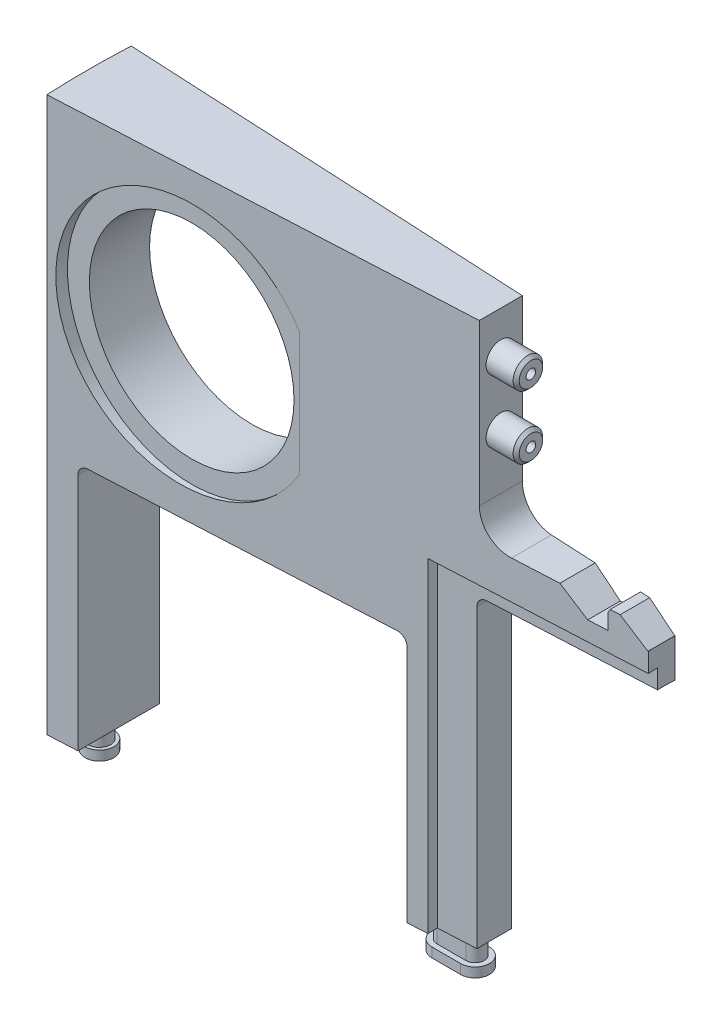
ISO-10303-21;
HEADER;
FILE_DESCRIPTION(('STEP AP214'),'2;1');
FILE_NAME('part.step','',(''),(''),'','','');
FILE_SCHEMA(('AUTOMOTIVE_DESIGN { 1 0 10303 214 1 1 1 1 }'));
ENDSEC;
DATA;
#1=APPLICATION_CONTEXT('core data for automotive mechanical design processes');
#2=APPLICATION_PROTOCOL_DEFINITION('international standard','automotive_design',2000,#1);
#3=PRODUCT_CONTEXT('',#1,'mechanical');
#4=PRODUCT('Part','Part','',(#3));
#5=PRODUCT_RELATED_PRODUCT_CATEGORY('part','',(#4));
#6=PRODUCT_DEFINITION_FORMATION('','',#4);
#7=PRODUCT_DEFINITION_CONTEXT('part definition',#1,'design');
#8=PRODUCT_DEFINITION('design','',#6,#7);
#9=PRODUCT_DEFINITION_SHAPE('','',#8);
#10=(LENGTH_UNIT() NAMED_UNIT(*) SI_UNIT(.MILLI.,.METRE.));
#11=(NAMED_UNIT(*) PLANE_ANGLE_UNIT() SI_UNIT($,.RADIAN.));
#12=(NAMED_UNIT(*) SI_UNIT($,.STERADIAN.) SOLID_ANGLE_UNIT());
#13=UNCERTAINTY_MEASURE_WITH_UNIT(LENGTH_MEASURE(1.E-05),#10,'distance_accuracy_value','');
#14=(GEOMETRIC_REPRESENTATION_CONTEXT(3) GLOBAL_UNCERTAINTY_ASSIGNED_CONTEXT((#13)) GLOBAL_UNIT_ASSIGNED_CONTEXT((#10,
#11,#12)) REPRESENTATION_CONTEXT('',''));
#15=CARTESIAN_POINT('',(0.,0.,0.));
#16=DIRECTION('',(0.,0.,1.));
#17=DIRECTION('',(1.,0.,0.));
#18=AXIS2_PLACEMENT_3D('',#15,#16,#17);
#19=CARTESIAN_POINT('',(-117.475,-25.4,-7.0069554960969));
#20=DIRECTION('',(0.,0.,1.));
#21=DIRECTION('',(1.,0.,0.));
#22=AXIS2_PLACEMENT_3D('',#19,#20,#21);
#23=CYLINDRICAL_SURFACE('',#22,17.);
#24=CARTESIAN_POINT('',(-117.475,-25.4,5.));
#25=DIRECTION('',(0.,0.,1.));
#26=DIRECTION('',(1.,0.,0.));
#27=AXIS2_PLACEMENT_3D('',#24,#25,#26);
#28=CIRCLE('',#27,17.);
#29=CARTESIAN_POINT('',(-100.475,-25.4,5.));
#30=VERTEX_POINT('',#29);
#31=EDGE_CURVE('E353',#30,#30,#28,.F.);
#32=ORIENTED_EDGE('',*,*,#31,.F.);
#33=EDGE_LOOP('',(#32));
#34=FACE_BOUND('',#33,.T.);
#35=CARTESIAN_POINT('',(-117.475,-25.4,-5.));
#36=DIRECTION('',(0.,0.,-1.));
#37=DIRECTION('',(-1.,0.,0.));
#38=AXIS2_PLACEMENT_3D('',#35,#36,#37);
#39=CIRCLE('',#38,17.);
#40=CARTESIAN_POINT('',(-134.475,-25.4,-5.));
#41=VERTEX_POINT('',#40);
#42=EDGE_CURVE('E349',#41,#41,#39,.F.);
#43=ORIENTED_EDGE('',*,*,#42,.F.);
#44=EDGE_LOOP('',(#43));
#45=FACE_BOUND('',#44,.T.);
#46=ADVANCED_FACE('F34',(#34,#45),#23,.F.);
#47=CARTESIAN_POINT('',(-139.524164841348,0.,7.0069554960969));
#48=DIRECTION('',(0.0501571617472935,0.,0.998741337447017));
#49=DIRECTION('',(0.998741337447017,0.,-0.0501571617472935));
#50=AXIS2_PLACEMENT_3D('',#47,#48,#49);
#51=PLANE('',#50);
#52=DIRECTION('',(0.499842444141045,0.865752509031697,-0.0251022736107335));
#53=VECTOR('',#52,1.);
#54=CARTESIAN_POINT('',(-59.0086915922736,-46.6028709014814,2.96343845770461));
#55=LINE('',#54,#53);
#56=CARTESIAN_POINT('',(-50.8,-32.385,2.55119491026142));
#57=VERTEX_POINT('',#56);
#58=CARTESIAN_POINT('',(-50.4333825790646,-31.75,2.53278324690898));
#59=VERTEX_POINT('',#58);
#60=EDGE_CURVE('E374',#57,#59,#55,.T.);
#61=ORIENTED_EDGE('',*,*,#60,.F.);
#62=DIRECTION('',(0.,1.,0.));
#63=VECTOR('',#62,1.);
#64=CARTESIAN_POINT('',(-50.8,0.,2.55119491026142));
#65=LINE('',#64,#63);
#66=CARTESIAN_POINT('',(-50.8,-34.925,2.55119491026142));
#67=VERTEX_POINT('',#66);
#68=EDGE_CURVE('E378',#67,#57,#65,.T.);
#69=ORIENTED_EDGE('',*,*,#68,.F.);
#70=DIRECTION('',(0.998741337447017,0.,-0.0501571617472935));
#71=VECTOR('',#70,1.);
#72=CARTESIAN_POINT('',(-139.524164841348,-34.925,7.0069554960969));
#73=LINE('',#72,#71);
#74=CARTESIAN_POINT('',(-53.975,-34.925,2.71064459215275));
#75=VERTEX_POINT('',#74);
#76=EDGE_CURVE('E376',#75,#67,#73,.T.);
#77=ORIENTED_EDGE('',*,*,#76,.F.);
#78=DIRECTION('',(0.809991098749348,-0.585029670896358,-0.0406780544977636));
#79=VECTOR('',#78,1.);
#80=CARTESIAN_POINT('',(-126.794000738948,17.6697459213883,6.36764191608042));
#81=LINE('',#80,#79);
#82=CARTESIAN_POINT('',(-58.3708825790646,-31.75,2.93140745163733));
#83=VERTEX_POINT('',#82);
#84=EDGE_CURVE('E369',#83,#75,#81,.T.);
#85=ORIENTED_EDGE('',*,*,#84,.F.);
#86=DIRECTION('',(0.998741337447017,0.,-0.0501571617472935));
#87=VECTOR('',#86,1.);
#88=CARTESIAN_POINT('',(-139.524164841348,-31.75,7.0069554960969));
#89=LINE('',#88,#87);
#90=CARTESIAN_POINT('',(-66.04,-31.75,3.31655338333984));
#91=VERTEX_POINT('',#90);
#92=EDGE_CURVE('E536',#91,#83,#89,.T.);
#93=ORIENTED_EDGE('',*,*,#92,.F.);
#94=CARTESIAN_POINT('',(-66.04,-26.67,3.31655338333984));
#95=DIRECTION('',(0.0501571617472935,0.,0.998741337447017));
#96=DIRECTION('',(0.998741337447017,0.,-0.0501571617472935));
#97=AXIS2_PLACEMENT_3D('',#94,#95,#96);
#98=ELLIPSE('',#97,5.08640206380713,5.08);
#99=CARTESIAN_POINT('',(-71.12,-26.67,3.57167287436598));
#100=VERTEX_POINT('',#99);
#101=EDGE_CURVE('E573',#91,#100,#98,.F.);
#102=ORIENTED_EDGE('',*,*,#101,.T.);
#103=DIRECTION('',(0.,1.,0.));
#104=VECTOR('',#103,1.);
#105=CARTESIAN_POINT('',(-71.12,-31.75,3.57167287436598));
#106=LINE('',#105,#104);
#107=CARTESIAN_POINT('',(-71.12,0.,3.57167287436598));
#108=VERTEX_POINT('',#107);
#109=EDGE_CURVE('E532',#100,#108,#106,.T.);
#110=ORIENTED_EDGE('',*,*,#109,.T.);
#111=DIRECTION('',(-0.998741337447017,0.,0.0501571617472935));
#112=VECTOR('',#111,1.);
#113=CARTESIAN_POINT('',(-44.3940524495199,0.,2.22948583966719));
#114=LINE('',#113,#112);
#115=CARTESIAN_POINT('',(-139.524164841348,0.,7.0069554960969));
#116=VERTEX_POINT('',#115);
#117=EDGE_CURVE('E553',#108,#116,#114,.T.);
#118=ORIENTED_EDGE('',*,*,#117,.T.);
#119=DIRECTION('',(0.,-1.,0.));
#120=VECTOR('',#119,1.);
#121=CARTESIAN_POINT('',(-139.524164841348,-95.25,7.0069554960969));
#122=LINE('',#121,#120);
#123=CARTESIAN_POINT('',(-139.524164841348,-92.075,7.0069554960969));
#124=VERTEX_POINT('',#123);
#125=EDGE_CURVE('E547',#116,#124,#122,.T.);
#126=ORIENTED_EDGE('',*,*,#125,.T.);
#127=DIRECTION('',(0.998741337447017,0.,-0.0501571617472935));
#128=VECTOR('',#127,1.);
#129=CARTESIAN_POINT('',(-139.524164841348,-92.075,7.0069554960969));
#130=LINE('',#129,#128);
#131=CARTESIAN_POINT('',(-134.62,-92.075,6.76066651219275));
#132=VERTEX_POINT('',#131);
#133=EDGE_CURVE('E479',#124,#132,#130,.T.);
#134=ORIENTED_EDGE('',*,*,#133,.T.);
#135=DIRECTION('',(0.,-1.,0.));
#136=VECTOR('',#135,1.);
#137=CARTESIAN_POINT('',(-134.62,-50.8,6.76066651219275));
#138=LINE('',#137,#136);
#139=CARTESIAN_POINT('',(-134.62,-52.3875,6.76066651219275));
#140=VERTEX_POINT('',#139);
#141=EDGE_CURVE('E526',#140,#132,#138,.T.);
#142=ORIENTED_EDGE('',*,*,#141,.F.);
#143=CARTESIAN_POINT('',(-133.0325,-52.3875,6.68094167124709));
#144=DIRECTION('',(0.0501571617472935,0.,0.998741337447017));
#145=DIRECTION('',(0.998741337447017,0.,-0.0501571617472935));
#146=AXIS2_PLACEMENT_3D('',#143,#144,#145);
#147=ELLIPSE('',#146,1.58950064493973,1.5875);
#148=CARTESIAN_POINT('',(-133.0325,-50.8,6.68094167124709));
#149=VERTEX_POINT('',#148);
#150=EDGE_CURVE('E608',#140,#149,#147,.F.);
#151=ORIENTED_EDGE('',*,*,#150,.T.);
#152=DIRECTION('',(-0.998741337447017,0.,0.0501571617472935));
#153=VECTOR('',#152,1.);
#154=CARTESIAN_POINT('',(-82.55,-50.8,4.1456917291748));
#155=LINE('',#154,#153);
#156=CARTESIAN_POINT('',(-84.1375,-50.8,4.22541657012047));
#157=VERTEX_POINT('',#156);
#158=EDGE_CURVE('E514',#157,#149,#155,.T.);
#159=ORIENTED_EDGE('',*,*,#158,.F.);
#160=CARTESIAN_POINT('',(-84.1375,-52.3875,4.22541657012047));
#161=DIRECTION('',(0.0501571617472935,0.,0.998741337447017));
#162=DIRECTION('',(-0.998741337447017,0.,0.0501571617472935));
#163=AXIS2_PLACEMENT_3D('',#160,#161,#162);
#164=ELLIPSE('',#163,1.58950064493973,1.5875);
#165=CARTESIAN_POINT('',(-82.55,-52.3875,4.1456917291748));
#166=VERTEX_POINT('',#165);
#167=EDGE_CURVE('E610',#157,#166,#164,.F.);
#168=ORIENTED_EDGE('',*,*,#167,.T.);
#169=DIRECTION('',(0.,-1.,0.));
#170=VECTOR('',#169,1.);
#171=CARTESIAN_POINT('',(-82.55,-50.8,4.1456917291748));
#172=LINE('',#171,#170);
#173=CARTESIAN_POINT('',(-82.55,-92.075,4.1456917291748));
#174=VERTEX_POINT('',#173);
#175=EDGE_CURVE('E520',#166,#174,#172,.T.);
#176=ORIENTED_EDGE('',*,*,#175,.T.);
#177=CARTESIAN_POINT('',(-79.2750936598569,-92.075,3.98122471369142));
#178=VERTEX_POINT('',#177);
#179=EDGE_CURVE('E475',#174,#178,#130,.T.);
#180=ORIENTED_EDGE('',*,*,#179,.T.);
#181=DIRECTION('',(0.,1.,0.));
#182=VECTOR('',#181,1.);
#183=CARTESIAN_POINT('',(-79.2750936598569,-95.25,3.98122471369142));
#184=LINE('',#183,#182);
#185=CARTESIAN_POINT('',(-79.2750936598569,-38.1,3.98122471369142));
#186=VERTEX_POINT('',#185);
#187=EDGE_CURVE('E502',#178,#186,#184,.T.);
#188=ORIENTED_EDGE('',*,*,#187,.T.);
#189=DIRECTION('',(-0.998741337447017,0.,0.0501571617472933));
#190=VECTOR('',#189,1.);
#191=CARTESIAN_POINT('',(-79.2750936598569,-38.1,3.98122471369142));
#192=LINE('',#191,#190);
#193=CARTESIAN_POINT('',(-44.3940524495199,-38.1,2.2294858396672));
#194=VERTEX_POINT('',#193);
#195=EDGE_CURVE('E491',#194,#186,#192,.T.);
#196=ORIENTED_EDGE('',*,*,#195,.F.);
#197=DIRECTION('',(0.,1.,0.));
#198=VECTOR('',#197,1.);
#199=CARTESIAN_POINT('',(-44.3940524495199,-95.25,2.22948583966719));
#200=LINE('',#199,#198);
#201=CARTESIAN_POINT('',(-44.3940524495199,-34.925,2.22948583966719));
#202=VERTEX_POINT('',#201);
#203=EDGE_CURVE('E550',#194,#202,#200,.T.);
#204=ORIENTED_EDGE('',*,*,#203,.T.);
#205=DIRECTION('',(0.998741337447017,0.,-0.0501571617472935));
#206=VECTOR('',#205,1.);
#207=CARTESIAN_POINT('',(-139.524164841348,-34.925,7.0069554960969));
#208=LINE('',#207,#206);
#209=CARTESIAN_POINT('',(-44.45,-34.925,2.23229554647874));
#210=VERTEX_POINT('',#209);
#211=EDGE_CURVE('E392',#210,#202,#208,.T.);
#212=ORIENTED_EDGE('',*,*,#211,.F.);
#213=DIRECTION('',(0.809991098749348,-0.585029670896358,-0.0406780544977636));
#214=VECTOR('',#213,1.);
#215=CARTESIAN_POINT('',(-123.533976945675,22.1947301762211,6.20392230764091));
#216=LINE('',#215,#214);
#217=CARTESIAN_POINT('',(-48.8458825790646,-31.75,2.45305840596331));
#218=VERTEX_POINT('',#217);
#219=EDGE_CURVE('E387',#218,#210,#216,.T.);
#220=ORIENTED_EDGE('',*,*,#219,.F.);
#221=EDGE_CURVE('E534',#59,#218,#89,.T.);
#222=ORIENTED_EDGE('',*,*,#221,.F.);
#223=EDGE_LOOP('',(#61,#69,#77,#85,#93,#102,#110,#118,#126,#134,#142,#151,#159,#168,#176,#180,
#188,#196,#204,#212,#220,#222));
#224=FACE_BOUND('',#223,.T.);
#225=DIRECTION('',(0.,-1.,0.));
#226=VECTOR('',#225,1.);
#227=CARTESIAN_POINT('',(-99.5611895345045,0.,5.));
#228=LINE('',#227,#226);
#229=CARTESIAN_POINT('',(-99.5611895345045,-15.1529613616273,5.));
#230=VERTEX_POINT('',#229);
#231=CARTESIAN_POINT('',(-99.5611895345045,-35.6470386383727,5.));
#232=VERTEX_POINT('',#231);
#233=EDGE_CURVE('E354',#230,#232,#228,.T.);
#234=ORIENTED_EDGE('',*,*,#233,.T.);
#235=CARTESIAN_POINT('',(-117.475,-25.4,5.89963822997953));
#236=DIRECTION('',(0.0501571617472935,0.,0.998741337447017));
#237=DIRECTION('',(0.998741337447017,0.,-0.0501571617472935));
#238=AXIS2_PLACEMENT_3D('',#235,#236,#237);
#239=ELLIPSE('',#238,20.6635083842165,20.6375);
#240=EDGE_CURVE('E633',#232,#230,#239,.F.);
#241=ORIENTED_EDGE('',*,*,#240,.T.);
#242=EDGE_LOOP('',(#234,#241));
#243=FACE_BOUND('',#242,.T.);
#244=ADVANCED_FACE('F678',(#224,#243),#51,.T.);
#245=CARTESIAN_POINT('',(0.,-31.75,0.));
#246=DIRECTION('',(0.,-1.,0.));
#247=DIRECTION('',(0.,0.,-1.));
#248=AXIS2_PLACEMENT_3D('',#245,#246,#247);
#249=PLANE('',#248);
#250=DIRECTION('',(0.998741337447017,0.,0.0501571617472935));
#251=VECTOR('',#250,1.);
#252=CARTESIAN_POINT('',(-139.524164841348,-31.75,-7.0069554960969));
#253=LINE('',#252,#251);
#254=CARTESIAN_POINT('',(-50.4333825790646,-31.75,-2.53278324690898));
#255=VERTEX_POINT('',#254);
#256=CARTESIAN_POINT('',(-48.8458825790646,-31.75,-2.45305840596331));
#257=VERTEX_POINT('',#256);
#258=EDGE_CURVE('E558',#255,#257,#253,.T.);
#259=ORIENTED_EDGE('',*,*,#258,.F.);
#260=DIRECTION('',(0.,0.,1.));
#261=VECTOR('',#260,1.);
#262=CARTESIAN_POINT('',(-50.4333825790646,-31.75,0.));
#263=LINE('',#262,#261);
#264=EDGE_CURVE('E624',#255,#59,#263,.T.);
#265=ORIENTED_EDGE('',*,*,#264,.T.);
#266=ORIENTED_EDGE('',*,*,#221,.T.);
#267=DIRECTION('',(0.,0.,-1.));
#268=VECTOR('',#267,1.);
#269=CARTESIAN_POINT('',(-48.8458825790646,-31.75,0.));
#270=LINE('',#269,#268);
#271=EDGE_CURVE('E614',#218,#257,#270,.T.);
#272=ORIENTED_EDGE('',*,*,#271,.T.);
#273=EDGE_LOOP('',(#259,#265,#266,#272));
#274=FACE_BOUND('',#273,.T.);
#275=ADVANCED_FACE('F684',(#274),#249,.F.);
#276=CARTESIAN_POINT('',(-73.025,-41.275,-12.4533550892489));
#277=DIRECTION('',(-1.,0.,0.));
#278=DIRECTION('',(0.,0.,1.));
#279=AXIS2_PLACEMENT_3D('',#276,#277,#278);
#280=PLANE('',#279);
#281=DIRECTION('',(0.,-1.,0.));
#282=VECTOR('',#281,1.);
#283=CARTESIAN_POINT('',(-73.025,0.,-3.66734268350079));
#284=LINE('',#283,#282);
#285=CARTESIAN_POINT('',(-73.025,-42.8625,-3.66734268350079));
#286=VERTEX_POINT('',#285);
#287=CARTESIAN_POINT('',(-73.025,-92.075,-3.66734268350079));
#288=VERTEX_POINT('',#287);
#289=EDGE_CURVE('E580',#286,#288,#284,.T.);
#290=ORIENTED_EDGE('',*,*,#289,.F.);
#291=DIRECTION('',(0.,0.,-1.));
#292=VECTOR('',#291,1.);
#293=CARTESIAN_POINT('',(-73.025,-42.8625,2.07784203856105));
#294=LINE('',#293,#292);
#295=CARTESIAN_POINT('',(-73.025,-42.8625,2.07784203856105));
#296=VERTEX_POINT('',#295);
#297=EDGE_CURVE('E590',#286,#296,#294,.F.);
#298=ORIENTED_EDGE('',*,*,#297,.T.);
#299=DIRECTION('',(0.,1.,0.));
#300=VECTOR('',#299,1.);
#301=CARTESIAN_POINT('',(-73.025,-41.275,2.07784203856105));
#302=LINE('',#301,#300);
#303=CARTESIAN_POINT('',(-73.025,-92.075,2.07784203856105));
#304=VERTEX_POINT('',#303);
#305=EDGE_CURVE('E504',#304,#296,#302,.T.);
#306=ORIENTED_EDGE('',*,*,#305,.F.);
#307=DIRECTION('',(0.,0.,1.));
#308=VECTOR('',#307,1.);
#309=CARTESIAN_POINT('',(-73.025,-92.075,-12.4533550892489));
#310=LINE('',#309,#308);
#311=EDGE_CURVE('E473',#288,#304,#310,.T.);
#312=ORIENTED_EDGE('',*,*,#311,.F.);
#313=EDGE_LOOP('',(#290,#298,#306,#312));
#314=FACE_BOUND('',#313,.T.);
#315=ADVANCED_FACE('F727',(#314),#280,.F.);
#316=CARTESIAN_POINT('',(0.,0.,0.));
#317=DIRECTION('',(0.,-1.,0.));
#318=DIRECTION('',(0.,0.,-1.));
#319=AXIS2_PLACEMENT_3D('',#316,#317,#318);
#320=CYLINDRICAL_SURFACE('',#319,139.7);
#321=CARTESIAN_POINT('',(0.,-92.075,0.));
#322=DIRECTION('',(0.,-1.,0.));
#323=DIRECTION('',(0.,0.,-1.));
#324=AXIS2_PLACEMENT_3D('',#321,#322,#323);
#325=CIRCLE('',#324,139.7);
#326=CARTESIAN_POINT('',(-139.524164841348,-92.075,-7.0069554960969));
#327=VERTEX_POINT('',#326);
#328=EDGE_CURVE('E489',#124,#327,#325,.T.);
#329=ORIENTED_EDGE('',*,*,#328,.F.);
#330=ORIENTED_EDGE('',*,*,#125,.F.);
#331=CARTESIAN_POINT('',(0.,0.,0.));
#332=DIRECTION('',(0.,-1.,0.));
#333=DIRECTION('',(0.,0.,-1.));
#334=AXIS2_PLACEMENT_3D('',#331,#332,#333);
#335=CIRCLE('',#334,139.7);
#336=CARTESIAN_POINT('',(-139.524164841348,0.,-7.0069554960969));
#337=VERTEX_POINT('',#336);
#338=EDGE_CURVE('E555',#116,#337,#335,.T.);
#339=ORIENTED_EDGE('',*,*,#338,.T.);
#340=DIRECTION('',(0.,-1.,0.));
#341=VECTOR('',#340,1.);
#342=CARTESIAN_POINT('',(-139.524164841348,-95.25,-7.0069554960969));
#343=LINE('',#342,#341);
#344=EDGE_CURVE('E539',#337,#327,#343,.T.);
#345=ORIENTED_EDGE('',*,*,#344,.T.);
#346=EDGE_LOOP('',(#329,#330,#339,#345));
#347=FACE_BOUND('',#346,.T.);
#348=ADVANCED_FACE('F722',(#347),#320,.T.);
#349=CARTESIAN_POINT('',(-139.524164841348,0.,-7.0069554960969));
#350=DIRECTION('',(-0.0501571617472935,0.,0.998741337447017));
#351=DIRECTION('',(0.998741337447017,0.,0.0501571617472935));
#352=AXIS2_PLACEMENT_3D('',#349,#350,#351);
#353=PLANE('',#352);
#354=DIRECTION('',(0.,-1.,0.));
#355=VECTOR('',#354,1.);
#356=CARTESIAN_POINT('',(-99.5611895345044,0.,-5.));
#357=LINE('',#356,#355);
#358=CARTESIAN_POINT('',(-99.5611895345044,-15.1529613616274,-5.));
#359=VERTEX_POINT('',#358);
#360=CARTESIAN_POINT('',(-99.5611895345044,-35.6470386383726,-5.));
#361=VERTEX_POINT('',#360);
#362=EDGE_CURVE('E638',#359,#361,#357,.T.);
#363=ORIENTED_EDGE('',*,*,#362,.F.);
#364=CARTESIAN_POINT('',(-117.475,-25.4,-5.89963822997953));
#365=DIRECTION('',(-0.0501571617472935,0.,0.998741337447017));
#366=DIRECTION('',(0.998741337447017,0.,0.0501571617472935));
#367=AXIS2_PLACEMENT_3D('',#364,#365,#366);
#368=ELLIPSE('',#367,20.6635083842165,20.6375);
#369=EDGE_CURVE('E640',#359,#361,#368,.T.);
#370=ORIENTED_EDGE('',*,*,#369,.T.);
#371=EDGE_LOOP('',(#363,#370));
#372=FACE_BOUND('',#371,.T.);
#373=DIRECTION('',(0.,1.,0.));
#374=VECTOR('',#373,1.);
#375=CARTESIAN_POINT('',(-50.8,0.,-2.55119491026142));
#376=LINE('',#375,#374);
#377=CARTESIAN_POINT('',(-50.8,-34.925,-2.55119491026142));
#378=VERTEX_POINT('',#377);
#379=CARTESIAN_POINT('',(-50.8,-32.385,-2.55119491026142));
#380=VERTEX_POINT('',#379);
#381=EDGE_CURVE('E630',#378,#380,#376,.T.);
#382=ORIENTED_EDGE('',*,*,#381,.T.);
#383=DIRECTION('',(0.499842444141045,0.865752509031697,0.0251022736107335));
#384=VECTOR('',#383,1.);
#385=CARTESIAN_POINT('',(-59.0086915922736,-46.6028709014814,-2.96343845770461));
#386=LINE('',#385,#384);
#387=EDGE_CURVE('E371',#380,#255,#386,.T.);
#388=ORIENTED_EDGE('',*,*,#387,.T.);
#389=ORIENTED_EDGE('',*,*,#258,.T.);
#390=DIRECTION('',(0.809991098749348,-0.585029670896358,0.0406780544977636));
#391=VECTOR('',#390,1.);
#392=CARTESIAN_POINT('',(-123.533976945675,22.1947301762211,-6.20392230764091));
#393=LINE('',#392,#391);
#394=CARTESIAN_POINT('',(-44.45,-34.925,-2.23229554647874));
#395=VERTEX_POINT('',#394);
#396=EDGE_CURVE('E384',#257,#395,#393,.T.);
#397=ORIENTED_EDGE('',*,*,#396,.T.);
#398=DIRECTION('',(0.998741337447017,0.,0.0501571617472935));
#399=VECTOR('',#398,1.);
#400=CARTESIAN_POINT('',(-139.524164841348,-34.925,-7.0069554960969));
#401=LINE('',#400,#399);
#402=CARTESIAN_POINT('',(-44.3940524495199,-34.925,-2.2294858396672));
#403=VERTEX_POINT('',#402);
#404=EDGE_CURVE('E389',#395,#403,#401,.T.);
#405=ORIENTED_EDGE('',*,*,#404,.T.);
#406=DIRECTION('',(0.,1.,0.));
#407=VECTOR('',#406,1.);
#408=CARTESIAN_POINT('',(-44.3940524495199,-95.25,-2.2294858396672));
#409=LINE('',#408,#407);
#410=CARTESIAN_POINT('',(-44.3940524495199,-41.275,-2.2294858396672));
#411=VERTEX_POINT('',#410);
#412=EDGE_CURVE('E542',#411,#403,#409,.T.);
#413=ORIENTED_EDGE('',*,*,#412,.F.);
#414=DIRECTION('',(-0.998741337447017,0.,-0.0501571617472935));
#415=VECTOR('',#414,1.);
#416=CARTESIAN_POINT('',(-139.524164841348,-41.275,-7.0069554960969));
#417=LINE('',#416,#415);
#418=CARTESIAN_POINT('',(-71.4375,-41.275,-3.58761784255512));
#419=VERTEX_POINT('',#418);
#420=EDGE_CURVE('E577',#411,#419,#417,.T.);
#421=ORIENTED_EDGE('',*,*,#420,.T.);
#422=CARTESIAN_POINT('',(-71.4375,-42.8625,-3.58761784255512));
#423=DIRECTION('',(-0.0501571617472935,0.,0.998741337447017));
#424=DIRECTION('',(0.998741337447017,0.,0.0501571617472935));
#425=AXIS2_PLACEMENT_3D('',#422,#423,#424);
#426=ELLIPSE('',#425,1.58950064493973,1.5875);
#427=EDGE_CURVE('E602',#419,#286,#426,.T.);
#428=ORIENTED_EDGE('',*,*,#427,.T.);
#429=ORIENTED_EDGE('',*,*,#289,.T.);
#430=DIRECTION('',(0.998741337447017,0.,0.0501571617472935));
#431=VECTOR('',#430,1.);
#432=CARTESIAN_POINT('',(-139.524164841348,-92.075,-7.0069554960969));
#433=LINE('',#432,#431);
#434=CARTESIAN_POINT('',(-82.55,-92.075,-4.1456917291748));
#435=VERTEX_POINT('',#434);
#436=EDGE_CURVE('E482',#435,#288,#433,.T.);
#437=ORIENTED_EDGE('',*,*,#436,.F.);
#438=DIRECTION('',(0.,-1.,0.));
#439=VECTOR('',#438,1.);
#440=CARTESIAN_POINT('',(-82.55,-50.8,-4.1456917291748));
#441=LINE('',#440,#439);
#442=CARTESIAN_POINT('',(-82.55,-52.3875,-4.1456917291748));
#443=VERTEX_POINT('',#442);
#444=EDGE_CURVE('E521',#443,#435,#441,.T.);
#445=ORIENTED_EDGE('',*,*,#444,.F.);
#446=CARTESIAN_POINT('',(-84.1375,-52.3875,-4.22541657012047));
#447=DIRECTION('',(-0.0501571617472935,0.,0.998741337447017));
#448=DIRECTION('',(0.998741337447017,0.,0.0501571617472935));
#449=AXIS2_PLACEMENT_3D('',#446,#447,#448);
#450=ELLIPSE('',#449,1.58950064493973,1.5875);
#451=CARTESIAN_POINT('',(-84.1375,-50.8,-4.22541657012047));
#452=VERTEX_POINT('',#451);
#453=EDGE_CURVE('E612',#443,#452,#450,.T.);
#454=ORIENTED_EDGE('',*,*,#453,.T.);
#455=DIRECTION('',(0.998741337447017,0.,0.0501571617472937));
#456=VECTOR('',#455,1.);
#457=CARTESIAN_POINT('',(-82.55,-50.8,-4.1456917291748));
#458=LINE('',#457,#456);
#459=CARTESIAN_POINT('',(-133.0325,-50.8,-6.6809416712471));
#460=VERTEX_POINT('',#459);
#461=EDGE_CURVE('E517',#460,#452,#458,.T.);
#462=ORIENTED_EDGE('',*,*,#461,.F.);
#463=CARTESIAN_POINT('',(-133.0325,-52.3875,-6.68094167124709));
#464=DIRECTION('',(-0.0501571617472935,0.,0.998741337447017));
#465=DIRECTION('',(-0.998741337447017,0.,-0.0501571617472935));
#466=AXIS2_PLACEMENT_3D('',#463,#464,#465);
#467=ELLIPSE('',#466,1.58950064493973,1.5875);
#468=CARTESIAN_POINT('',(-134.62,-52.3875,-6.76066651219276));
#469=VERTEX_POINT('',#468);
#470=EDGE_CURVE('E606',#460,#469,#467,.T.);
#471=ORIENTED_EDGE('',*,*,#470,.T.);
#472=DIRECTION('',(0.,-1.,0.));
#473=VECTOR('',#472,1.);
#474=CARTESIAN_POINT('',(-134.62,-50.8,-6.76066651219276));
#475=LINE('',#474,#473);
#476=CARTESIAN_POINT('',(-134.62,-92.075,-6.76066651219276));
#477=VERTEX_POINT('',#476);
#478=EDGE_CURVE('E524',#469,#477,#475,.T.);
#479=ORIENTED_EDGE('',*,*,#478,.T.);
#480=EDGE_CURVE('E486',#327,#477,#433,.T.);
#481=ORIENTED_EDGE('',*,*,#480,.F.);
#482=ORIENTED_EDGE('',*,*,#344,.F.);
#483=DIRECTION('',(-0.998741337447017,0.,-0.0501571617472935));
#484=VECTOR('',#483,1.);
#485=CARTESIAN_POINT('',(-82.4460974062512,0.,-4.14047370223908));
#486=LINE('',#485,#484);
#487=CARTESIAN_POINT('',(-71.12,0.,-3.57167287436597));
#488=VERTEX_POINT('',#487);
#489=EDGE_CURVE('E545',#488,#337,#486,.T.);
#490=ORIENTED_EDGE('',*,*,#489,.F.);
#491=DIRECTION('',(0.,1.,0.));
#492=VECTOR('',#491,1.);
#493=CARTESIAN_POINT('',(-71.12,-31.75,-3.57167287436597));
#494=LINE('',#493,#492);
#495=CARTESIAN_POINT('',(-71.12,-26.67,-3.57167287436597));
#496=VERTEX_POINT('',#495);
#497=EDGE_CURVE('E531',#496,#488,#494,.T.);
#498=ORIENTED_EDGE('',*,*,#497,.F.);
#499=CARTESIAN_POINT('',(-66.04,-26.67,-3.31655338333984));
#500=DIRECTION('',(-0.0501571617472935,0.,0.998741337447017));
#501=DIRECTION('',(-0.998741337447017,0.,-0.0501571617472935));
#502=AXIS2_PLACEMENT_3D('',#499,#500,#501);
#503=ELLIPSE('',#502,5.08640206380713,5.08);
#504=CARTESIAN_POINT('',(-66.04,-31.75,-3.31655338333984));
#505=VERTEX_POINT('',#504);
#506=EDGE_CURVE('E575',#496,#505,#503,.T.);
#507=ORIENTED_EDGE('',*,*,#506,.T.);
#508=CARTESIAN_POINT('',(-58.3708825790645,-31.75,-2.93140745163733));
#509=VERTEX_POINT('',#508);
#510=EDGE_CURVE('E559',#505,#509,#253,.T.);
#511=ORIENTED_EDGE('',*,*,#510,.T.);
#512=DIRECTION('',(0.809991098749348,-0.585029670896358,0.0406780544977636));
#513=VECTOR('',#512,1.);
#514=CARTESIAN_POINT('',(-126.794000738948,17.6697459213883,-6.36764191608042));
#515=LINE('',#514,#513);
#516=CARTESIAN_POINT('',(-53.975,-34.925,-2.71064459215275));
#517=VERTEX_POINT('',#516);
#518=EDGE_CURVE('E361',#509,#517,#515,.T.);
#519=ORIENTED_EDGE('',*,*,#518,.T.);
#520=DIRECTION('',(0.998741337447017,0.,0.0501571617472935));
#521=VECTOR('',#520,1.);
#522=CARTESIAN_POINT('',(-139.524164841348,-34.925,-7.0069554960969));
#523=LINE('',#522,#521);
#524=EDGE_CURVE('E627',#517,#378,#523,.T.);
#525=ORIENTED_EDGE('',*,*,#524,.T.);
#526=EDGE_LOOP('',(#382,#388,#389,#397,#405,#413,#421,#428,#429,#437,#445,#454,#462,#471,#479,
#481,#482,#490,#498,#507,#511,#519,#525));
#527=FACE_BOUND('',#526,.T.);
#528=ADVANCED_FACE('F720',(#372,#527),#353,.F.);
#529=CARTESIAN_POINT('',(-82.55,-50.8,-4.1456917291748));
#530=DIRECTION('',(1.,0.,0.));
#531=DIRECTION('',(0.,0.,-1.));
#532=AXIS2_PLACEMENT_3D('',#529,#530,#531);
#533=PLANE('',#532);
#534=ORIENTED_EDGE('',*,*,#175,.F.);
#535=DIRECTION('',(0.,0.,1.));
#536=VECTOR('',#535,1.);
#537=CARTESIAN_POINT('',(-82.55,-52.3875,-4.1456917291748));
#538=LINE('',#537,#536);
#539=EDGE_CURVE('E600',#166,#443,#538,.F.);
#540=ORIENTED_EDGE('',*,*,#539,.T.);
#541=ORIENTED_EDGE('',*,*,#444,.T.);
#542=DIRECTION('',(0.,0.,-1.));
#543=VECTOR('',#542,1.);
#544=CARTESIAN_POINT('',(-82.55,-92.075,-4.1456917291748));
#545=LINE('',#544,#543);
#546=EDGE_CURVE('E478',#174,#435,#545,.T.);
#547=ORIENTED_EDGE('',*,*,#546,.F.);
#548=EDGE_LOOP('',(#534,#540,#541,#547));
#549=FACE_BOUND('',#548,.T.);
#550=ADVANCED_FACE('F691',(#549),#533,.F.);
#551=CARTESIAN_POINT('',(-134.62,-50.8,-6.76066651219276));
#552=DIRECTION('',(-1.,0.,0.));
#553=DIRECTION('',(0.,0.,1.));
#554=AXIS2_PLACEMENT_3D('',#551,#552,#553);
#555=PLANE('',#554);
#556=ORIENTED_EDGE('',*,*,#478,.F.);
#557=DIRECTION('',(0.,0.,-1.));
#558=VECTOR('',#557,1.);
#559=CARTESIAN_POINT('',(-134.62,-52.3875,-6.76066651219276));
#560=LINE('',#559,#558);
#561=EDGE_CURVE('E598',#469,#140,#560,.F.);
#562=ORIENTED_EDGE('',*,*,#561,.T.);
#563=ORIENTED_EDGE('',*,*,#141,.T.);
#564=DIRECTION('',(0.,0.,1.));
#565=VECTOR('',#564,1.);
#566=CARTESIAN_POINT('',(-134.62,-92.075,-6.76066651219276));
#567=LINE('',#566,#565);
#568=EDGE_CURVE('E485',#477,#132,#567,.T.);
#569=ORIENTED_EDGE('',*,*,#568,.F.);
#570=EDGE_LOOP('',(#556,#562,#563,#569));
#571=FACE_BOUND('',#570,.T.);
#572=ADVANCED_FACE('F881',(#571),#555,.F.);
#573=CARTESIAN_POINT('',(-34.8810412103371,-95.25,0.162238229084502));
#574=DIRECTION('',(0.0501571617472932,0.,0.998741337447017));
#575=DIRECTION('',(0.998741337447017,0.,-0.0501571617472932));
#576=AXIS2_PLACEMENT_3D('',#573,#574,#575);
#577=PLANE('',#576);
#578=DIRECTION('',(0.,1.,0.));
#579=VECTOR('',#578,1.);
#580=CARTESIAN_POINT('',(-79.2750936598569,-95.25,2.39172406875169));
#581=LINE('',#580,#579);
#582=CARTESIAN_POINT('',(-79.2750936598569,-92.075,2.39172406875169));
#583=VERTEX_POINT('',#582);
#584=CARTESIAN_POINT('',(-79.2750936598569,-38.1,2.39172406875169));
#585=VERTEX_POINT('',#584);
#586=EDGE_CURVE('E500',#583,#585,#581,.T.);
#587=ORIENTED_EDGE('',*,*,#586,.F.);
#588=DIRECTION('',(0.998741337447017,0.,-0.0501571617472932));
#589=VECTOR('',#588,1.);
#590=CARTESIAN_POINT('',(-34.8810412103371,-92.075,0.162238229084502));
#591=LINE('',#590,#589);
#592=EDGE_CURVE('E468',#583,#304,#591,.T.);
#593=ORIENTED_EDGE('',*,*,#592,.T.);
#594=ORIENTED_EDGE('',*,*,#305,.T.);
#595=CARTESIAN_POINT('',(-71.4375,-42.8625,1.99811719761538));
#596=DIRECTION('',(0.0501571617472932,0.,0.998741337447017));
#597=DIRECTION('',(-0.998741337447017,0.,0.0501571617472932));
#598=AXIS2_PLACEMENT_3D('',#595,#596,#597);
#599=ELLIPSE('',#598,1.58950064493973,1.5875);
#600=CARTESIAN_POINT('',(-71.4375,-41.275,1.99811719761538));
#601=VERTEX_POINT('',#600);
#602=EDGE_CURVE('E604',#296,#601,#599,.F.);
#603=ORIENTED_EDGE('',*,*,#602,.T.);
#604=DIRECTION('',(0.998741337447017,0.,-0.0501571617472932));
#605=VECTOR('',#604,1.);
#606=CARTESIAN_POINT('',(-0.0796244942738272,-41.275,-1.58550187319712));
#607=LINE('',#606,#605);
#608=CARTESIAN_POINT('',(-44.4453553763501,-41.275,0.642561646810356));
#609=VERTEX_POINT('',#608);
#610=EDGE_CURVE('E582',#601,#609,#607,.T.);
#611=ORIENTED_EDGE('',*,*,#610,.T.);
#612=DIRECTION('',(0.,-1.,0.));
#613=VECTOR('',#612,1.);
#614=CARTESIAN_POINT('',(-44.44535537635,0.,0.642561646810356));
#615=LINE('',#614,#613);
#616=CARTESIAN_POINT('',(-44.44535537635,-38.1,0.642561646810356));
#617=VERTEX_POINT('',#616);
#618=EDGE_CURVE('E507',#609,#617,#615,.F.);
#619=ORIENTED_EDGE('',*,*,#618,.T.);
#620=DIRECTION('',(0.998741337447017,0.,-0.0501571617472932));
#621=VECTOR('',#620,1.);
#622=CARTESIAN_POINT('',(-34.8810412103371,-38.1,0.162238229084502));
#623=LINE('',#622,#621);
#624=EDGE_CURVE('E497',#585,#617,#623,.T.);
#625=ORIENTED_EDGE('',*,*,#624,.F.);
#626=EDGE_LOOP('',(#587,#593,#594,#603,#611,#619,#625));
#627=FACE_BOUND('',#626,.T.);
#628=ADVANCED_FACE('F878',(#627),#577,.T.);
#629=CARTESIAN_POINT('',(-79.2750936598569,-95.25,2.39172406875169));
#630=DIRECTION('',(1.,0.,0.));
#631=DIRECTION('',(0.,0.,-1.));
#632=AXIS2_PLACEMENT_3D('',#629,#630,#631);
#633=PLANE('',#632);
#634=ORIENTED_EDGE('',*,*,#187,.F.);
#635=DIRECTION('',(0.,0.,-1.));
#636=VECTOR('',#635,1.);
#637=CARTESIAN_POINT('',(-79.2750936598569,-92.075,2.39172406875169));
#638=LINE('',#637,#636);
#639=EDGE_CURVE('E584',#178,#583,#638,.T.);
#640=ORIENTED_EDGE('',*,*,#639,.T.);
#641=ORIENTED_EDGE('',*,*,#586,.T.);
#642=DIRECTION('',(0.,0.,-1.));
#643=VECTOR('',#642,1.);
#644=CARTESIAN_POINT('',(-79.2750936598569,-38.1,2.39172406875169));
#645=LINE('',#644,#643);
#646=EDGE_CURVE('E494',#186,#585,#645,.T.);
#647=ORIENTED_EDGE('',*,*,#646,.F.);
#648=EDGE_LOOP('',(#634,#640,#641,#647));
#649=FACE_BOUND('',#648,.T.);
#650=ADVANCED_FACE('F735',(#649),#633,.T.);
#651=CARTESIAN_POINT('',(0.,0.,0.));
#652=DIRECTION('',(0.,-1.,0.));
#653=DIRECTION('',(0.,0.,-1.));
#654=AXIS2_PLACEMENT_3D('',#651,#652,#653);
#655=CYLINDRICAL_SURFACE('',#654,44.45);
#656=ORIENTED_EDGE('',*,*,#412,.T.);
#657=CARTESIAN_POINT('',(0.,-34.925,0.));
#658=DIRECTION('',(0.,-1.,0.));
#659=DIRECTION('',(0.,0.,-1.));
#660=AXIS2_PLACEMENT_3D('',#657,#658,#659);
#661=CIRCLE('',#660,44.45);
#662=CARTESIAN_POINT('',(-44.45,-34.925,0.));
#663=VERTEX_POINT('',#662);
#664=EDGE_CURVE('E620',#403,#663,#661,.F.);
#665=ORIENTED_EDGE('',*,*,#664,.T.);
#666=EDGE_CURVE('E617',#663,#202,#661,.F.);
#667=ORIENTED_EDGE('',*,*,#666,.T.);
#668=ORIENTED_EDGE('',*,*,#203,.F.);
#669=CARTESIAN_POINT('',(0.,-38.1,0.));
#670=DIRECTION('',(0.,1.,0.));
#671=DIRECTION('',(0.,0.,1.));
#672=AXIS2_PLACEMENT_3D('',#669,#670,#671);
#673=CIRCLE('',#672,44.45);
#674=EDGE_CURVE('E509',#194,#617,#673,.F.);
#675=ORIENTED_EDGE('',*,*,#674,.T.);
#676=ORIENTED_EDGE('',*,*,#618,.F.);
#677=CARTESIAN_POINT('',(0.,-41.275,0.));
#678=DIRECTION('',(0.,1.,0.));
#679=DIRECTION('',(0.,0.,1.));
#680=AXIS2_PLACEMENT_3D('',#677,#678,#679);
#681=CIRCLE('',#680,44.45);
#682=EDGE_CURVE('E512',#609,#411,#681,.F.);
#683=ORIENTED_EDGE('',*,*,#682,.T.);
#684=EDGE_LOOP('',(#656,#665,#667,#668,#675,#676,#683));
#685=FACE_BOUND('',#684,.T.);
#686=ADVANCED_FACE('F732',(#685),#655,.F.);
#687=CARTESIAN_POINT('',(0.,-41.275,0.));
#688=DIRECTION('',(0.,1.,0.));
#689=DIRECTION('',(0.,0.,1.));
#690=AXIS2_PLACEMENT_3D('',#687,#688,#689);
#691=PLANE('',#690);
#692=ORIENTED_EDGE('',*,*,#610,.F.);
#693=DIRECTION('',(0.,0.,-1.));
#694=VECTOR('',#693,1.);
#695=CARTESIAN_POINT('',(-71.4375,-41.275,-3.66734268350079));
#696=LINE('',#695,#694);
#697=EDGE_CURVE('E587',#601,#419,#696,.T.);
#698=ORIENTED_EDGE('',*,*,#697,.T.);
#699=ORIENTED_EDGE('',*,*,#420,.F.);
#700=ORIENTED_EDGE('',*,*,#682,.F.);
#701=EDGE_LOOP('',(#692,#698,#699,#700));
#702=FACE_BOUND('',#701,.T.);
#703=ADVANCED_FACE('F718',(#702),#691,.F.);
#704=CARTESIAN_POINT('',(-71.12,-31.75,-3.57167287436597));
#705=DIRECTION('',(-1.,0.,0.));
#706=DIRECTION('',(0.,0.,1.));
#707=AXIS2_PLACEMENT_3D('',#704,#705,#706);
#708=PLANE('',#707);
#709=CARTESIAN_POINT('',(-71.12,-7.00000000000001,0.));
#710=DIRECTION('',(-1.,0.,0.));
#711=DIRECTION('',(0.,0.,1.));
#712=AXIS2_PLACEMENT_3D('',#709,#710,#711);
#713=CIRCLE('',#712,2.45);
#714=CARTESIAN_POINT('',(-71.12,-7.00000000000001,2.45));
#715=VERTEX_POINT('',#714);
#716=EDGE_CURVE('E562',#715,#715,#713,.F.);
#717=ORIENTED_EDGE('',*,*,#716,.F.);
#718=EDGE_LOOP('',(#717));
#719=FACE_BOUND('',#718,.T.);
#720=ORIENTED_EDGE('',*,*,#109,.F.);
#721=DIRECTION('',(0.,0.,1.));
#722=VECTOR('',#721,1.);
#723=CARTESIAN_POINT('',(-71.12,-26.67,-3.57167287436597));
#724=LINE('',#723,#722);
#725=EDGE_CURVE('E571',#100,#496,#724,.F.);
#726=ORIENTED_EDGE('',*,*,#725,.T.);
#727=ORIENTED_EDGE('',*,*,#497,.T.);
#728=DIRECTION('',(0.,0.,1.));
#729=VECTOR('',#728,1.);
#730=CARTESIAN_POINT('',(-71.12,0.,-3.57167287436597));
#731=LINE('',#730,#729);
#732=EDGE_CURVE('E523',#488,#108,#731,.T.);
#733=ORIENTED_EDGE('',*,*,#732,.T.);
#734=EDGE_LOOP('',(#720,#726,#727,#733));
#735=FACE_BOUND('',#734,.T.);
#736=CARTESIAN_POINT('',(-71.12,-17.5,0.));
#737=DIRECTION('',(-1.,0.,0.));
#738=DIRECTION('',(0.,0.,1.));
#739=AXIS2_PLACEMENT_3D('',#736,#737,#738);
#740=CIRCLE('',#739,2.45);
#741=CARTESIAN_POINT('',(-71.12,-17.5,2.45));
#742=VERTEX_POINT('',#741);
#743=EDGE_CURVE('E565',#742,#742,#740,.F.);
#744=ORIENTED_EDGE('',*,*,#743,.F.);
#745=EDGE_LOOP('',(#744));
#746=FACE_BOUND('',#745,.T.);
#747=ADVANCED_FACE('F715',(#719,#735,#746),#708,.F.);
#748=CARTESIAN_POINT('',(-82.4460974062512,0.,4.14047370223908));
#749=DIRECTION('',(0.,-1.,0.));
#750=DIRECTION('',(0.,0.,-1.));
#751=AXIS2_PLACEMENT_3D('',#748,#749,#750);
#752=PLANE('',#751);
#753=ORIENTED_EDGE('',*,*,#117,.F.);
#754=ORIENTED_EDGE('',*,*,#732,.F.);
#755=ORIENTED_EDGE('',*,*,#489,.T.);
#756=ORIENTED_EDGE('',*,*,#338,.F.);
#757=EDGE_LOOP('',(#753,#754,#755,#756));
#758=FACE_BOUND('',#757,.T.);
#759=ADVANCED_FACE('F713',(#758),#752,.F.);
#760=ORIENTED_EDGE('',*,*,#92,.T.);
#761=DIRECTION('',(0.,0.,-1.));
#762=VECTOR('',#761,1.);
#763=CARTESIAN_POINT('',(-58.3708825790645,-31.75,0.));
#764=LINE('',#763,#762);
#765=EDGE_CURVE('E621',#83,#509,#764,.T.);
#766=ORIENTED_EDGE('',*,*,#765,.T.);
#767=ORIENTED_EDGE('',*,*,#510,.F.);
#768=DIRECTION('',(0.,0.,1.));
#769=VECTOR('',#768,1.);
#770=CARTESIAN_POINT('',(-66.04,-31.75,3.57167287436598));
#771=LINE('',#770,#769);
#772=EDGE_CURVE('E568',#505,#91,#771,.T.);
#773=ORIENTED_EDGE('',*,*,#772,.T.);
#774=EDGE_LOOP('',(#760,#766,#767,#773));
#775=FACE_BOUND('',#774,.T.);
#776=ADVANCED_FACE('F709',(#775),#249,.F.);
#777=CARTESIAN_POINT('',(-66.12,-7.00000000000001,0.));
#778=DIRECTION('',(-1.,0.,0.));
#779=DIRECTION('',(0.,0.,1.));
#780=AXIS2_PLACEMENT_3D('',#777,#778,#779);
#781=CYLINDRICAL_SURFACE('',#780,2.45);
#782=CARTESIAN_POINT('',(-66.628,-7.00000000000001,0.));
#783=DIRECTION('',(1.,0.,0.));
#784=DIRECTION('',(0.,0.,-1.));
#785=AXIS2_PLACEMENT_3D('',#782,#783,#784);
#786=CIRCLE('',#785,2.45);
#787=CARTESIAN_POINT('',(-66.628,-7.00000000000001,-2.45));
#788=VERTEX_POINT('',#787);
#789=EDGE_CURVE('E11',#788,#788,#786,.F.);
#790=ORIENTED_EDGE('',*,*,#789,.T.);
#791=EDGE_LOOP('',(#790));
#792=FACE_BOUND('',#791,.T.);
#793=ORIENTED_EDGE('',*,*,#716,.T.);
#794=EDGE_LOOP('',(#793));
#795=FACE_BOUND('',#794,.T.);
#796=ADVANCED_FACE('F705',(#792,#795),#781,.T.);
#797=CARTESIAN_POINT('',(-66.12,-7.00000000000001,0.));
#798=DIRECTION('',(1.,0.,0.));
#799=DIRECTION('',(0.,0.,-1.));
#800=AXIS2_PLACEMENT_3D('',#797,#798,#799);
#801=PLANE('',#800);
#802=CARTESIAN_POINT('',(-66.12,-7.00000000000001,0.));
#803=DIRECTION('',(1.,0.,0.));
#804=DIRECTION('',(0.,0.,-1.));
#805=AXIS2_PLACEMENT_3D('',#802,#803,#804);
#806=CIRCLE('',#805,0.793749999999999);
#807=CARTESIAN_POINT('',(-66.12,-7.00000000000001,-0.793749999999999));
#808=VERTEX_POINT('',#807);
#809=EDGE_CURVE('E299',#808,#808,#806,.T.);
#810=ORIENTED_EDGE('',*,*,#809,.F.);
#811=EDGE_LOOP('',(#810));
#812=FACE_BOUND('',#811,.T.);
#813=CARTESIAN_POINT('',(-66.12,-7.00000000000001,0.));
#814=DIRECTION('',(1.,0.,0.));
#815=DIRECTION('',(0.,0.,-1.));
#816=AXIS2_PLACEMENT_3D('',#813,#814,#815);
#817=CIRCLE('',#816,1.942);
#818=CARTESIAN_POINT('',(-66.12,-7.00000000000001,-1.942));
#819=VERTEX_POINT('',#818);
#820=EDGE_CURVE('E43',#819,#819,#817,.T.);
#821=ORIENTED_EDGE('',*,*,#820,.T.);
#822=EDGE_LOOP('',(#821));
#823=FACE_BOUND('',#822,.T.);
#824=ADVANCED_FACE('F701',(#812,#823),#801,.T.);
#825=CARTESIAN_POINT('',(-66.12,-17.5,0.));
#826=DIRECTION('',(-1.,0.,0.));
#827=DIRECTION('',(0.,0.,1.));
#828=AXIS2_PLACEMENT_3D('',#825,#826,#827);
#829=CYLINDRICAL_SURFACE('',#828,2.45);
#830=CARTESIAN_POINT('',(-66.628,-17.5,0.));
#831=DIRECTION('',(1.,0.,0.));
#832=DIRECTION('',(0.,0.,-1.));
#833=AXIS2_PLACEMENT_3D('',#830,#831,#832);
#834=CIRCLE('',#833,2.45);
#835=CARTESIAN_POINT('',(-66.628,-17.5,-2.45));
#836=VERTEX_POINT('',#835);
#837=EDGE_CURVE('E646',#836,#836,#834,.F.);
#838=ORIENTED_EDGE('',*,*,#837,.T.);
#839=EDGE_LOOP('',(#838));
#840=FACE_BOUND('',#839,.T.);
#841=ORIENTED_EDGE('',*,*,#743,.T.);
#842=EDGE_LOOP('',(#841));
#843=FACE_BOUND('',#842,.T.);
#844=ADVANCED_FACE('F697',(#840,#843),#829,.T.);
#845=CARTESIAN_POINT('',(-66.12,-17.5,0.));
#846=DIRECTION('',(1.,0.,0.));
#847=DIRECTION('',(0.,0.,-1.));
#848=AXIS2_PLACEMENT_3D('',#845,#846,#847);
#849=PLANE('',#848);
#850=CARTESIAN_POINT('',(-66.12,-17.5,0.));
#851=DIRECTION('',(1.,0.,0.));
#852=DIRECTION('',(0.,0.,-1.));
#853=AXIS2_PLACEMENT_3D('',#850,#851,#852);
#854=CIRCLE('',#853,0.793749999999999);
#855=CARTESIAN_POINT('',(-66.12,-17.5,-0.793749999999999));
#856=VERTEX_POINT('',#855);
#857=EDGE_CURVE('E298',#856,#856,#854,.T.);
#858=ORIENTED_EDGE('',*,*,#857,.F.);
#859=EDGE_LOOP('',(#858));
#860=FACE_BOUND('',#859,.T.);
#861=CARTESIAN_POINT('',(-66.12,-17.5,0.));
#862=DIRECTION('',(1.,0.,0.));
#863=DIRECTION('',(0.,0.,-1.));
#864=AXIS2_PLACEMENT_3D('',#861,#862,#863);
#865=CIRCLE('',#864,1.942);
#866=CARTESIAN_POINT('',(-66.12,-17.5,-1.942));
#867=VERTEX_POINT('',#866);
#868=EDGE_CURVE('E643',#867,#867,#865,.T.);
#869=ORIENTED_EDGE('',*,*,#868,.T.);
#870=EDGE_LOOP('',(#869));
#871=FACE_BOUND('',#870,.T.);
#872=ADVANCED_FACE('F693',(#860,#871),#849,.T.);
#873=CARTESIAN_POINT('',(-66.04,-26.67,0.));
#874=DIRECTION('',(0.,0.,-1.));
#875=DIRECTION('',(-1.,0.,0.));
#876=AXIS2_PLACEMENT_3D('',#873,#874,#875);
#877=CYLINDRICAL_SURFACE('',#876,5.08);
#878=ORIENTED_EDGE('',*,*,#506,.F.);
#879=ORIENTED_EDGE('',*,*,#725,.F.);
#880=ORIENTED_EDGE('',*,*,#101,.F.);
#881=ORIENTED_EDGE('',*,*,#772,.F.);
#882=EDGE_LOOP('',(#878,#879,#880,#881));
#883=FACE_BOUND('',#882,.T.);
#884=ADVANCED_FACE('F696',(#883),#877,.F.);
#885=CARTESIAN_POINT('',(0.,-50.8,0.));
#886=DIRECTION('',(0.,-1.,0.));
#887=DIRECTION('',(0.,0.,-1.));
#888=AXIS2_PLACEMENT_3D('',#885,#886,#887);
#889=PLANE('',#888);
#890=CARTESIAN_POINT('',(-88.9,-50.8,0.));
#891=DIRECTION('',(0.,-1.,0.));
#892=DIRECTION('',(0.,0.,-1.));
#893=AXIS2_PLACEMENT_3D('',#890,#891,#892);
#894=CIRCLE('',#893,1.58750000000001);
#895=CARTESIAN_POINT('',(-88.9,-50.8,-1.58750000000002));
#896=VERTEX_POINT('',#895);
#897=EDGE_CURVE('E309',#896,#896,#894,.T.);
#898=ORIENTED_EDGE('',*,*,#897,.F.);
#899=EDGE_LOOP('',(#898));
#900=FACE_BOUND('',#899,.T.);
#901=CARTESIAN_POINT('',(-101.6,-50.8,0.));
#902=DIRECTION('',(0.,-1.,0.));
#903=DIRECTION('',(0.,0.,-1.));
#904=AXIS2_PLACEMENT_3D('',#901,#902,#903);
#905=CIRCLE('',#904,1.58750000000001);
#906=CARTESIAN_POINT('',(-101.6,-50.8,-1.58750000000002));
#907=VERTEX_POINT('',#906);
#908=EDGE_CURVE('E315',#907,#907,#905,.T.);
#909=ORIENTED_EDGE('',*,*,#908,.F.);
#910=EDGE_LOOP('',(#909));
#911=FACE_BOUND('',#910,.T.);
#912=CARTESIAN_POINT('',(-114.3,-50.8,0.));
#913=DIRECTION('',(0.,-1.,0.));
#914=DIRECTION('',(0.,0.,-1.));
#915=AXIS2_PLACEMENT_3D('',#912,#913,#914);
#916=CIRCLE('',#915,1.58750000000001);
#917=CARTESIAN_POINT('',(-114.3,-50.8,-1.58750000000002));
#918=VERTEX_POINT('',#917);
#919=EDGE_CURVE('E322',#918,#918,#916,.T.);
#920=ORIENTED_EDGE('',*,*,#919,.F.);
#921=EDGE_LOOP('',(#920));
#922=FACE_BOUND('',#921,.T.);
#923=CARTESIAN_POINT('',(-127.,-50.8,0.));
#924=DIRECTION('',(0.,-1.,0.));
#925=DIRECTION('',(0.,0.,-1.));
#926=AXIS2_PLACEMENT_3D('',#923,#924,#925);
#927=CIRCLE('',#926,1.58749999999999);
#928=CARTESIAN_POINT('',(-127.,-50.8,-1.58750000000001));
#929=VERTEX_POINT('',#928);
#930=EDGE_CURVE('E338',#929,#929,#927,.T.);
#931=ORIENTED_EDGE('',*,*,#930,.F.);
#932=EDGE_LOOP('',(#931));
#933=FACE_BOUND('',#932,.T.);
#934=ORIENTED_EDGE('',*,*,#158,.T.);
#935=DIRECTION('',(0.,0.,-1.));
#936=VECTOR('',#935,1.);
#937=CARTESIAN_POINT('',(-133.0325,-50.8,0.));
#938=LINE('',#937,#936);
#939=EDGE_CURVE('E595',#149,#460,#938,.T.);
#940=ORIENTED_EDGE('',*,*,#939,.T.);
#941=ORIENTED_EDGE('',*,*,#461,.T.);
#942=DIRECTION('',(0.,0.,1.));
#943=VECTOR('',#942,1.);
#944=CARTESIAN_POINT('',(-84.1375,-50.8,0.));
#945=LINE('',#944,#943);
#946=EDGE_CURVE('E592',#452,#157,#945,.T.);
#947=ORIENTED_EDGE('',*,*,#946,.T.);
#948=EDGE_LOOP('',(#934,#940,#941,#947));
#949=FACE_BOUND('',#948,.T.);
#950=ADVANCED_FACE('F739',(#900,#911,#922,#933,#949),#889,.T.);
#951=CARTESIAN_POINT('',(0.,-38.1,0.));
#952=DIRECTION('',(0.,1.,0.));
#953=DIRECTION('',(0.,0.,1.));
#954=AXIS2_PLACEMENT_3D('',#951,#952,#953);
#955=PLANE('',#954);
#956=ORIENTED_EDGE('',*,*,#195,.T.);
#957=ORIENTED_EDGE('',*,*,#646,.T.);
#958=ORIENTED_EDGE('',*,*,#624,.T.);
#959=ORIENTED_EDGE('',*,*,#674,.F.);
#960=EDGE_LOOP('',(#956,#957,#958,#959));
#961=FACE_BOUND('',#960,.T.);
#962=ADVANCED_FACE('F874',(#961),#955,.F.);
#963=CARTESIAN_POINT('',(-134.62,-92.075,0.));
#964=DIRECTION('',(0.,-1.,0.));
#965=DIRECTION('',(0.,0.,-1.));
#966=AXIS2_PLACEMENT_3D('',#963,#964,#965);
#967=PLANE('',#966);
#968=DIRECTION('',(-1.,0.,0.));
#969=VECTOR('',#968,1.);
#970=CARTESIAN_POINT('',(-80.1751,-92.075,1.52400000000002));
#971=LINE('',#970,#969);
#972=CARTESIAN_POINT('',(-75.3999,-92.075,1.52400000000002));
#973=VERTEX_POINT('',#972);
#974=CARTESIAN_POINT('',(-80.1751,-92.075,1.52400000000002));
#975=VERTEX_POINT('',#974);
#976=EDGE_CURVE('E441',#973,#975,#971,.T.);
#977=ORIENTED_EDGE('',*,*,#976,.F.);
#978=CARTESIAN_POINT('',(-75.3999,-92.075,0.));
#979=DIRECTION('',(0.,-1.,0.));
#980=DIRECTION('',(0.,0.,-1.));
#981=AXIS2_PLACEMENT_3D('',#978,#979,#980);
#982=CIRCLE('',#981,1.524);
#983=CARTESIAN_POINT('',(-75.3999,-92.075,-1.52399999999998));
#984=VERTEX_POINT('',#983);
#985=EDGE_CURVE('E438',#984,#973,#982,.T.);
#986=ORIENTED_EDGE('',*,*,#985,.F.);
#987=DIRECTION('',(1.,0.,0.));
#988=VECTOR('',#987,1.);
#989=CARTESIAN_POINT('',(-80.1751,-92.075,-1.52399999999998));
#990=LINE('',#989,#988);
#991=CARTESIAN_POINT('',(-80.1751,-92.075,-1.52399999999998));
#992=VERTEX_POINT('',#991);
#993=EDGE_CURVE('E434',#992,#984,#990,.T.);
#994=ORIENTED_EDGE('',*,*,#993,.F.);
#995=CARTESIAN_POINT('',(-80.1751,-92.075,0.));
#996=DIRECTION('',(0.,-1.,0.));
#997=DIRECTION('',(0.,0.,-1.));
#998=AXIS2_PLACEMENT_3D('',#995,#996,#997);
#999=CIRCLE('',#998,1.524);
#1000=EDGE_CURVE('E431',#975,#992,#999,.T.);
#1001=ORIENTED_EDGE('',*,*,#1000,.F.);
#1002=EDGE_LOOP('',(#977,#986,#994,#1001));
#1003=FACE_BOUND('',#1002,.T.);
#1004=ORIENTED_EDGE('',*,*,#436,.T.);
#1005=ORIENTED_EDGE('',*,*,#311,.T.);
#1006=ORIENTED_EDGE('',*,*,#592,.F.);
#1007=ORIENTED_EDGE('',*,*,#639,.F.);
#1008=ORIENTED_EDGE('',*,*,#179,.F.);
#1009=ORIENTED_EDGE('',*,*,#546,.T.);
#1010=EDGE_LOOP('',(#1004,#1005,#1006,#1007,#1008,#1009));
#1011=FACE_BOUND('',#1010,.T.);
#1012=ADVANCED_FACE('F862',(#1003,#1011),#967,.T.);
#1013=CARTESIAN_POINT('',(-80.1751,-92.075,-1.52399999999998));
#1014=DIRECTION('',(0.,0.,-1.));
#1015=DIRECTION('',(-1.,0.,0.));
#1016=AXIS2_PLACEMENT_3D('',#1013,#1014,#1015);
#1017=PLANE('',#1016);
#1018=DIRECTION('',(1.,0.,0.));
#1019=VECTOR('',#1018,1.);
#1020=CARTESIAN_POINT('',(-80.1751,-95.25,-1.52399999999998));
#1021=LINE('',#1020,#1019);
#1022=CARTESIAN_POINT('',(-80.1751,-95.25,-1.52400000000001));
#1023=VERTEX_POINT('',#1022);
#1024=CARTESIAN_POINT('',(-75.3999,-95.25,-1.52399999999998));
#1025=VERTEX_POINT('',#1024);
#1026=EDGE_CURVE('E447',#1023,#1025,#1021,.T.);
#1027=ORIENTED_EDGE('',*,*,#1026,.F.);
#1028=DIRECTION('',(0.,-1.,0.));
#1029=VECTOR('',#1028,1.);
#1030=CARTESIAN_POINT('',(-80.1751,-92.075,-1.52399999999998));
#1031=LINE('',#1030,#1029);
#1032=EDGE_CURVE('E444',#992,#1023,#1031,.T.);
#1033=ORIENTED_EDGE('',*,*,#1032,.F.);
#1034=ORIENTED_EDGE('',*,*,#993,.T.);
#1035=DIRECTION('',(0.,-1.,0.));
#1036=VECTOR('',#1035,1.);
#1037=CARTESIAN_POINT('',(-75.3999,-92.075,-1.52400000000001));
#1038=LINE('',#1037,#1036);
#1039=EDGE_CURVE('E460',#984,#1025,#1038,.T.);
#1040=ORIENTED_EDGE('',*,*,#1039,.T.);
#1041=EDGE_LOOP('',(#1027,#1033,#1034,#1040));
#1042=FACE_BOUND('',#1041,.T.);
#1043=ADVANCED_FACE('F858',(#1042),#1017,.T.);
#1044=CARTESIAN_POINT('',(-75.3999,-92.075,0.));
#1045=DIRECTION('',(0.,-1.,0.));
#1046=DIRECTION('',(0.,0.,-1.));
#1047=AXIS2_PLACEMENT_3D('',#1044,#1045,#1046);
#1048=CYLINDRICAL_SURFACE('',#1047,1.524);
#1049=CARTESIAN_POINT('',(-75.3999,-95.25,0.));
#1050=DIRECTION('',(0.,-1.,0.));
#1051=DIRECTION('',(0.,0.,-1.));
#1052=AXIS2_PLACEMENT_3D('',#1049,#1050,#1051);
#1053=CIRCLE('',#1052,1.524);
#1054=CARTESIAN_POINT('',(-75.3999,-95.25,1.52400000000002));
#1055=VERTEX_POINT('',#1054);
#1056=EDGE_CURVE('E450',#1025,#1055,#1053,.T.);
#1057=ORIENTED_EDGE('',*,*,#1056,.F.);
#1058=ORIENTED_EDGE('',*,*,#1039,.F.);
#1059=ORIENTED_EDGE('',*,*,#985,.T.);
#1060=DIRECTION('',(0.,-1.,0.));
#1061=VECTOR('',#1060,1.);
#1062=CARTESIAN_POINT('',(-75.3999,-92.075,1.52400000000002));
#1063=LINE('',#1062,#1061);
#1064=EDGE_CURVE('E458',#973,#1055,#1063,.T.);
#1065=ORIENTED_EDGE('',*,*,#1064,.T.);
#1066=EDGE_LOOP('',(#1057,#1058,#1059,#1065));
#1067=FACE_BOUND('',#1066,.T.);
#1068=ADVANCED_FACE('F854',(#1067),#1048,.T.);
#1069=CARTESIAN_POINT('',(-80.1751,-92.075,1.52400000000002));
#1070=DIRECTION('',(0.,0.,1.));
#1071=DIRECTION('',(1.,0.,0.));
#1072=AXIS2_PLACEMENT_3D('',#1069,#1070,#1071);
#1073=PLANE('',#1072);
#1074=DIRECTION('',(-1.,0.,0.));
#1075=VECTOR('',#1074,1.);
#1076=CARTESIAN_POINT('',(-80.1751,-95.25,1.52400000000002));
#1077=LINE('',#1076,#1075);
#1078=CARTESIAN_POINT('',(-80.1751,-95.25,1.52400000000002));
#1079=VERTEX_POINT('',#1078);
#1080=EDGE_CURVE('E435',#1055,#1079,#1077,.T.);
#1081=ORIENTED_EDGE('',*,*,#1080,.F.);
#1082=ORIENTED_EDGE('',*,*,#1064,.F.);
#1083=ORIENTED_EDGE('',*,*,#976,.T.);
#1084=DIRECTION('',(0.,-1.,0.));
#1085=VECTOR('',#1084,1.);
#1086=CARTESIAN_POINT('',(-80.1751,-92.075,1.52400000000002));
#1087=LINE('',#1086,#1085);
#1088=EDGE_CURVE('E455',#975,#1079,#1087,.T.);
#1089=ORIENTED_EDGE('',*,*,#1088,.T.);
#1090=EDGE_LOOP('',(#1081,#1082,#1083,#1089));
#1091=FACE_BOUND('',#1090,.T.);
#1092=ADVANCED_FACE('F850',(#1091),#1073,.T.);
#1093=CARTESIAN_POINT('',(-80.1751,-92.075,0.));
#1094=DIRECTION('',(0.,-1.,0.));
#1095=DIRECTION('',(0.,0.,-1.));
#1096=AXIS2_PLACEMENT_3D('',#1093,#1094,#1095);
#1097=CYLINDRICAL_SURFACE('',#1096,1.524);
#1098=CARTESIAN_POINT('',(-80.1751,-95.25,0.));
#1099=DIRECTION('',(0.,-1.,0.));
#1100=DIRECTION('',(0.,0.,-1.));
#1101=AXIS2_PLACEMENT_3D('',#1098,#1099,#1100);
#1102=CIRCLE('',#1101,1.524);
#1103=EDGE_CURVE('E428',#1079,#1023,#1102,.T.);
#1104=ORIENTED_EDGE('',*,*,#1103,.F.);
#1105=ORIENTED_EDGE('',*,*,#1088,.F.);
#1106=ORIENTED_EDGE('',*,*,#1000,.T.);
#1107=ORIENTED_EDGE('',*,*,#1032,.T.);
#1108=EDGE_LOOP('',(#1104,#1105,#1106,#1107));
#1109=FACE_BOUND('',#1108,.T.);
#1110=ADVANCED_FACE('F853',(#1109),#1097,.T.);
#1111=ORIENTED_EDGE('',*,*,#328,.T.);
#1112=ORIENTED_EDGE('',*,*,#480,.T.);
#1113=ORIENTED_EDGE('',*,*,#568,.T.);
#1114=ORIENTED_EDGE('',*,*,#133,.F.);
#1115=EDGE_LOOP('',(#1111,#1112,#1113,#1114));
#1116=FACE_BOUND('',#1115,.T.);
#1117=CARTESIAN_POINT('',(-137.795,-92.075,0.));
#1118=DIRECTION('',(0.,-1.,0.));
#1119=DIRECTION('',(0.,0.,-1.));
#1120=AXIS2_PLACEMENT_3D('',#1117,#1118,#1119);
#1121=CIRCLE('',#1120,1.84149999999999);
#1122=CARTESIAN_POINT('',(-137.795,-92.075,-1.8415));
#1123=VERTEX_POINT('',#1122);
#1124=EDGE_CURVE('E465',#1123,#1123,#1121,.T.);
#1125=ORIENTED_EDGE('',*,*,#1124,.F.);
#1126=EDGE_LOOP('',(#1125));
#1127=FACE_BOUND('',#1126,.T.);
#1128=ADVANCED_FACE('F866',(#1116,#1127),#967,.T.);
#1129=CARTESIAN_POINT('',(-137.795,-92.075,0.));
#1130=DIRECTION('',(0.,-1.,0.));
#1131=DIRECTION('',(0.,0.,-1.));
#1132=AXIS2_PLACEMENT_3D('',#1129,#1130,#1131);
#1133=CYLINDRICAL_SURFACE('',#1132,1.84149999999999);
#1134=ORIENTED_EDGE('',*,*,#1124,.T.);
#1135=EDGE_LOOP('',(#1134));
#1136=FACE_BOUND('',#1135,.T.);
#1137=CARTESIAN_POINT('',(-137.795,-95.25,0.));
#1138=DIRECTION('',(0.,-1.,0.));
#1139=DIRECTION('',(0.,0.,-1.));
#1140=AXIS2_PLACEMENT_3D('',#1137,#1138,#1139);
#1141=CIRCLE('',#1140,1.84149999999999);
#1142=CARTESIAN_POINT('',(-137.795,-95.25,-1.8415));
#1143=VERTEX_POINT('',#1142);
#1144=EDGE_CURVE('E457',#1143,#1143,#1141,.T.);
#1145=ORIENTED_EDGE('',*,*,#1144,.F.);
#1146=EDGE_LOOP('',(#1145));
#1147=FACE_BOUND('',#1146,.T.);
#1148=ADVANCED_FACE('F848',(#1136,#1147),#1133,.T.);
#1149=CARTESIAN_POINT('',(-137.795,-96.8375,0.));
#1150=DIRECTION('',(0.,1.,0.));
#1151=DIRECTION('',(0.,0.,1.));
#1152=AXIS2_PLACEMENT_3D('',#1149,#1150,#1151);
#1153=CYLINDRICAL_SURFACE('',#1152,2.38759999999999);
#1154=CARTESIAN_POINT('',(-137.795,-96.8375,0.));
#1155=DIRECTION('',(0.,-1.,0.));
#1156=DIRECTION('',(0.,0.,-1.));
#1157=AXIS2_PLACEMENT_3D('',#1154,#1155,#1156);
#1158=CIRCLE('',#1157,2.38759999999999);
#1159=CARTESIAN_POINT('',(-137.795,-96.8375,-2.38760000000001));
#1160=VERTEX_POINT('',#1159);
#1161=EDGE_CURVE('E425',#1160,#1160,#1158,.T.);
#1162=ORIENTED_EDGE('',*,*,#1161,.F.);
#1163=EDGE_LOOP('',(#1162));
#1164=FACE_BOUND('',#1163,.T.);
#1165=CARTESIAN_POINT('',(-137.795,-95.25,0.));
#1166=DIRECTION('',(0.,-1.,0.));
#1167=DIRECTION('',(0.,0.,-1.));
#1168=AXIS2_PLACEMENT_3D('',#1165,#1166,#1167);
#1169=CIRCLE('',#1168,2.38759999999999);
#1170=CARTESIAN_POINT('',(-137.795,-95.25,-2.38760000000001));
#1171=VERTEX_POINT('',#1170);
#1172=EDGE_CURVE('E424',#1171,#1171,#1169,.T.);
#1173=ORIENTED_EDGE('',*,*,#1172,.T.);
#1174=EDGE_LOOP('',(#1173));
#1175=FACE_BOUND('',#1174,.T.);
#1176=ADVANCED_FACE('F841',(#1164,#1175),#1153,.T.);
#1177=CARTESIAN_POINT('',(-137.795,-96.8375,0.));
#1178=DIRECTION('',(0.,-1.,0.));
#1179=DIRECTION('',(0.,0.,-1.));
#1180=AXIS2_PLACEMENT_3D('',#1177,#1178,#1179);
#1181=PLANE('',#1180);
#1182=ORIENTED_EDGE('',*,*,#1161,.T.);
#1183=EDGE_LOOP('',(#1182));
#1184=FACE_BOUND('',#1183,.T.);
#1185=ADVANCED_FACE('F838',(#1184),#1181,.T.);
#1186=CARTESIAN_POINT('',(-137.795,-95.25,0.));
#1187=DIRECTION('',(0.,-1.,0.));
#1188=DIRECTION('',(0.,0.,-1.));
#1189=AXIS2_PLACEMENT_3D('',#1186,#1187,#1188);
#1190=PLANE('',#1189);
#1191=ORIENTED_EDGE('',*,*,#1144,.T.);
#1192=EDGE_LOOP('',(#1191));
#1193=FACE_BOUND('',#1192,.T.);
#1194=ORIENTED_EDGE('',*,*,#1172,.F.);
#1195=EDGE_LOOP('',(#1194));
#1196=FACE_BOUND('',#1195,.T.);
#1197=ADVANCED_FACE('F836',(#1193,#1196),#1190,.F.);
#1198=CARTESIAN_POINT('',(-80.1751,-96.8375,0.));
#1199=DIRECTION('',(0.,1.,0.));
#1200=DIRECTION('',(0.,0.,1.));
#1201=AXIS2_PLACEMENT_3D('',#1198,#1199,#1200);
#1202=CYLINDRICAL_SURFACE('',#1201,2.3876);
#1203=CARTESIAN_POINT('',(-80.1751,-95.25,0.));
#1204=DIRECTION('',(0.,-1.,0.));
#1205=DIRECTION('',(0.,0.,-1.));
#1206=AXIS2_PLACEMENT_3D('',#1203,#1204,#1205);
#1207=CIRCLE('',#1206,2.3876);
#1208=CARTESIAN_POINT('',(-80.1751,-95.25,2.3876));
#1209=VERTEX_POINT('',#1208);
#1210=CARTESIAN_POINT('',(-80.1751,-95.25,-2.3876));
#1211=VERTEX_POINT('',#1210);
#1212=EDGE_CURVE('E394',#1209,#1211,#1207,.T.);
#1213=ORIENTED_EDGE('',*,*,#1212,.T.);
#1214=DIRECTION('',(0.,1.,0.));
#1215=VECTOR('',#1214,1.);
#1216=CARTESIAN_POINT('',(-80.1751,-96.8375,-2.3876));
#1217=LINE('',#1216,#1215);
#1218=CARTESIAN_POINT('',(-80.1751,-96.8375,-2.3876));
#1219=VERTEX_POINT('',#1218);
#1220=EDGE_CURVE('E421',#1219,#1211,#1217,.T.);
#1221=ORIENTED_EDGE('',*,*,#1220,.F.);
#1222=CARTESIAN_POINT('',(-80.1751,-96.8375,0.));
#1223=DIRECTION('',(0.,-1.,0.));
#1224=DIRECTION('',(0.,0.,-1.));
#1225=AXIS2_PLACEMENT_3D('',#1222,#1223,#1224);
#1226=CIRCLE('',#1225,2.3876);
#1227=CARTESIAN_POINT('',(-80.1751,-96.8375,2.3876));
#1228=VERTEX_POINT('',#1227);
#1229=EDGE_CURVE('E395',#1228,#1219,#1226,.T.);
#1230=ORIENTED_EDGE('',*,*,#1229,.F.);
#1231=DIRECTION('',(0.,1.,0.));
#1232=VECTOR('',#1231,1.);
#1233=CARTESIAN_POINT('',(-80.1751,-96.8375,2.3876));
#1234=LINE('',#1233,#1232);
#1235=EDGE_CURVE('E405',#1228,#1209,#1234,.T.);
#1236=ORIENTED_EDGE('',*,*,#1235,.T.);
#1237=EDGE_LOOP('',(#1213,#1221,#1230,#1236));
#1238=FACE_BOUND('',#1237,.T.);
#1239=ADVANCED_FACE('F832',(#1238),#1202,.T.);
#1240=CARTESIAN_POINT('',(-80.1751,-96.8375,-2.3876));
#1241=DIRECTION('',(0.,0.,1.));
#1242=DIRECTION('',(1.,0.,0.));
#1243=AXIS2_PLACEMENT_3D('',#1240,#1241,#1242);
#1244=PLANE('',#1243);
#1245=DIRECTION('',(1.,0.,0.));
#1246=VECTOR('',#1245,1.);
#1247=CARTESIAN_POINT('',(-80.1751,-95.25,-2.3876));
#1248=LINE('',#1247,#1246);
#1249=CARTESIAN_POINT('',(-75.3999,-95.25,-2.38760000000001));
#1250=VERTEX_POINT('',#1249);
#1251=EDGE_CURVE('E408',#1211,#1250,#1248,.T.);
#1252=ORIENTED_EDGE('',*,*,#1251,.T.);
#1253=DIRECTION('',(0.,1.,0.));
#1254=VECTOR('',#1253,1.);
#1255=CARTESIAN_POINT('',(-75.3999,-96.8375,-2.38760000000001));
#1256=LINE('',#1255,#1254);
#1257=CARTESIAN_POINT('',(-75.3999,-96.8375,-2.38760000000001));
#1258=VERTEX_POINT('',#1257);
#1259=EDGE_CURVE('E418',#1258,#1250,#1256,.T.);
#1260=ORIENTED_EDGE('',*,*,#1259,.F.);
#1261=DIRECTION('',(1.,0.,0.));
#1262=VECTOR('',#1261,1.);
#1263=CARTESIAN_POINT('',(-80.1751,-96.8375,-2.3876));
#1264=LINE('',#1263,#1262);
#1265=EDGE_CURVE('E398',#1219,#1258,#1264,.T.);
#1266=ORIENTED_EDGE('',*,*,#1265,.F.);
#1267=ORIENTED_EDGE('',*,*,#1220,.T.);
#1268=EDGE_LOOP('',(#1252,#1260,#1266,#1267));
#1269=FACE_BOUND('',#1268,.T.);
#1270=ADVANCED_FACE('F828',(#1269),#1244,.F.);
#1271=CARTESIAN_POINT('',(-75.3999,-96.8375,0.));
#1272=DIRECTION('',(0.,1.,0.));
#1273=DIRECTION('',(0.,0.,1.));
#1274=AXIS2_PLACEMENT_3D('',#1271,#1272,#1273);
#1275=CYLINDRICAL_SURFACE('',#1274,2.3876);
#1276=CARTESIAN_POINT('',(-75.3999,-95.25,0.));
#1277=DIRECTION('',(0.,-1.,0.));
#1278=DIRECTION('',(0.,0.,-1.));
#1279=AXIS2_PLACEMENT_3D('',#1276,#1277,#1278);
#1280=CIRCLE('',#1279,2.3876);
#1281=CARTESIAN_POINT('',(-75.3999,-95.25,2.3876));
#1282=VERTEX_POINT('',#1281);
#1283=EDGE_CURVE('E410',#1250,#1282,#1280,.T.);
#1284=ORIENTED_EDGE('',*,*,#1283,.T.);
#1285=DIRECTION('',(0.,1.,0.));
#1286=VECTOR('',#1285,1.);
#1287=CARTESIAN_POINT('',(-75.3999,-96.8375,2.3876));
#1288=LINE('',#1287,#1286);
#1289=CARTESIAN_POINT('',(-75.3999,-96.8375,2.3876));
#1290=VERTEX_POINT('',#1289);
#1291=EDGE_CURVE('E415',#1290,#1282,#1288,.T.);
#1292=ORIENTED_EDGE('',*,*,#1291,.F.);
#1293=CARTESIAN_POINT('',(-75.3999,-96.8375,0.));
#1294=DIRECTION('',(0.,-1.,0.));
#1295=DIRECTION('',(0.,0.,-1.));
#1296=AXIS2_PLACEMENT_3D('',#1293,#1294,#1295);
#1297=CIRCLE('',#1296,2.3876);
#1298=EDGE_CURVE('E401',#1258,#1290,#1297,.T.);
#1299=ORIENTED_EDGE('',*,*,#1298,.F.);
#1300=ORIENTED_EDGE('',*,*,#1259,.T.);
#1301=EDGE_LOOP('',(#1284,#1292,#1299,#1300));
#1302=FACE_BOUND('',#1301,.T.);
#1303=ADVANCED_FACE('F824',(#1302),#1275,.T.);
#1304=CARTESIAN_POINT('',(-80.1751,-96.8375,2.3876));
#1305=DIRECTION('',(0.,0.,-1.));
#1306=DIRECTION('',(-1.,0.,0.));
#1307=AXIS2_PLACEMENT_3D('',#1304,#1305,#1306);
#1308=PLANE('',#1307);
#1309=DIRECTION('',(-1.,0.,0.));
#1310=VECTOR('',#1309,1.);
#1311=CARTESIAN_POINT('',(-80.1751,-95.25,2.3876));
#1312=LINE('',#1311,#1310);
#1313=EDGE_CURVE('E399',#1282,#1209,#1312,.T.);
#1314=ORIENTED_EDGE('',*,*,#1313,.T.);
#1315=ORIENTED_EDGE('',*,*,#1235,.F.);
#1316=DIRECTION('',(-1.,0.,0.));
#1317=VECTOR('',#1316,1.);
#1318=CARTESIAN_POINT('',(-80.1751,-96.8375,2.3876));
#1319=LINE('',#1318,#1317);
#1320=EDGE_CURVE('E403',#1290,#1228,#1319,.T.);
#1321=ORIENTED_EDGE('',*,*,#1320,.F.);
#1322=ORIENTED_EDGE('',*,*,#1291,.T.);
#1323=EDGE_LOOP('',(#1314,#1315,#1321,#1322));
#1324=FACE_BOUND('',#1323,.T.);
#1325=ADVANCED_FACE('F817',(#1324),#1308,.F.);
#1326=CARTESIAN_POINT('',(-80.1751,-96.8375,0.));
#1327=DIRECTION('',(0.,-1.,0.));
#1328=DIRECTION('',(0.,0.,-1.));
#1329=AXIS2_PLACEMENT_3D('',#1326,#1327,#1328);
#1330=PLANE('',#1329);
#1331=ORIENTED_EDGE('',*,*,#1229,.T.);
#1332=ORIENTED_EDGE('',*,*,#1265,.T.);
#1333=ORIENTED_EDGE('',*,*,#1298,.T.);
#1334=ORIENTED_EDGE('',*,*,#1320,.T.);
#1335=EDGE_LOOP('',(#1331,#1332,#1333,#1334));
#1336=FACE_BOUND('',#1335,.T.);
#1337=ADVANCED_FACE('F814',(#1336),#1330,.T.);
#1338=CARTESIAN_POINT('',(-80.1751,-95.25,0.));
#1339=DIRECTION('',(0.,-1.,0.));
#1340=DIRECTION('',(0.,0.,-1.));
#1341=AXIS2_PLACEMENT_3D('',#1338,#1339,#1340);
#1342=PLANE('',#1341);
#1343=ORIENTED_EDGE('',*,*,#1026,.T.);
#1344=ORIENTED_EDGE('',*,*,#1056,.T.);
#1345=ORIENTED_EDGE('',*,*,#1080,.T.);
#1346=ORIENTED_EDGE('',*,*,#1103,.T.);
#1347=EDGE_LOOP('',(#1343,#1344,#1345,#1346));
#1348=FACE_BOUND('',#1347,.T.);
#1349=ORIENTED_EDGE('',*,*,#1212,.F.);
#1350=ORIENTED_EDGE('',*,*,#1313,.F.);
#1351=ORIENTED_EDGE('',*,*,#1283,.F.);
#1352=ORIENTED_EDGE('',*,*,#1251,.F.);
#1353=EDGE_LOOP('',(#1349,#1350,#1351,#1352));
#1354=FACE_BOUND('',#1353,.T.);
#1355=ADVANCED_FACE('F745',(#1348,#1354),#1342,.F.);
#1356=CARTESIAN_POINT('',(-71.4375,-42.8625,0.));
#1357=DIRECTION('',(0.,0.,1.));
#1358=DIRECTION('',(1.,0.,0.));
#1359=AXIS2_PLACEMENT_3D('',#1356,#1357,#1358);
#1360=CYLINDRICAL_SURFACE('',#1359,1.5875);
#1361=ORIENTED_EDGE('',*,*,#602,.F.);
#1362=ORIENTED_EDGE('',*,*,#297,.F.);
#1363=ORIENTED_EDGE('',*,*,#427,.F.);
#1364=ORIENTED_EDGE('',*,*,#697,.F.);
#1365=EDGE_LOOP('',(#1361,#1362,#1363,#1364));
#1366=FACE_BOUND('',#1365,.T.);
#1367=ADVANCED_FACE('F741',(#1366),#1360,.F.);
#1368=CARTESIAN_POINT('',(-133.0325,-52.3875,0.));
#1369=DIRECTION('',(0.,0.,-1.));
#1370=DIRECTION('',(-1.,0.,0.));
#1371=AXIS2_PLACEMENT_3D('',#1368,#1369,#1370);
#1372=CYLINDRICAL_SURFACE('',#1371,1.5875);
#1373=ORIENTED_EDGE('',*,*,#150,.F.);
#1374=ORIENTED_EDGE('',*,*,#561,.F.);
#1375=ORIENTED_EDGE('',*,*,#470,.F.);
#1376=ORIENTED_EDGE('',*,*,#939,.F.);
#1377=EDGE_LOOP('',(#1373,#1374,#1375,#1376));
#1378=FACE_BOUND('',#1377,.T.);
#1379=ADVANCED_FACE('F744',(#1378),#1372,.F.);
#1380=CARTESIAN_POINT('',(-84.1375,-52.3875,0.));
#1381=DIRECTION('',(0.,0.,1.));
#1382=DIRECTION('',(1.,0.,0.));
#1383=AXIS2_PLACEMENT_3D('',#1380,#1381,#1382);
#1384=CYLINDRICAL_SURFACE('',#1383,1.5875);
#1385=ORIENTED_EDGE('',*,*,#453,.F.);
#1386=ORIENTED_EDGE('',*,*,#539,.F.);
#1387=ORIENTED_EDGE('',*,*,#167,.F.);
#1388=ORIENTED_EDGE('',*,*,#946,.F.);
#1389=EDGE_LOOP('',(#1385,#1386,#1387,#1388));
#1390=FACE_BOUND('',#1389,.T.);
#1391=ADVANCED_FACE('F749',(#1390),#1384,.F.);
#1392=CARTESIAN_POINT('',(-44.45,-34.925,-7.0069554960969));
#1393=DIRECTION('',(0.,-1.,0.));
#1394=DIRECTION('',(0.,0.,-1.));
#1395=AXIS2_PLACEMENT_3D('',#1392,#1393,#1394);
#1396=PLANE('',#1395);
#1397=DIRECTION('',(0.,0.,1.));
#1398=VECTOR('',#1397,1.);
#1399=CARTESIAN_POINT('',(-44.45,-34.925,-7.0069554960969));
#1400=LINE('',#1399,#1398);
#1401=EDGE_CURVE('E383',#395,#663,#1400,.T.);
#1402=ORIENTED_EDGE('',*,*,#1401,.T.);
#1403=ORIENTED_EDGE('',*,*,#664,.F.);
#1404=ORIENTED_EDGE('',*,*,#404,.F.);
#1405=EDGE_LOOP('',(#1402,#1403,#1404));
#1406=FACE_BOUND('',#1405,.T.);
#1407=ADVANCED_FACE('F752',(#1406),#1396,.F.);
#1408=CARTESIAN_POINT('',(-48.8458825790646,-31.75,-7.0069554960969));
#1409=DIRECTION('',(-0.585514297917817,-0.810662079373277,0.));
#1410=DIRECTION('',(0.810662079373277,-0.585514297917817,0.));
#1411=AXIS2_PLACEMENT_3D('',#1408,#1409,#1410);
#1412=PLANE('',#1411);
#1413=ORIENTED_EDGE('',*,*,#219,.T.);
#1414=EDGE_CURVE('E380',#663,#210,#1400,.T.);
#1415=ORIENTED_EDGE('',*,*,#1414,.F.);
#1416=ORIENTED_EDGE('',*,*,#1401,.F.);
#1417=ORIENTED_EDGE('',*,*,#396,.F.);
#1418=ORIENTED_EDGE('',*,*,#271,.F.);
#1419=EDGE_LOOP('',(#1413,#1415,#1416,#1417,#1418));
#1420=FACE_BOUND('',#1419,.T.);
#1421=ADVANCED_FACE('F809',(#1420),#1412,.F.);
#1422=ORIENTED_EDGE('',*,*,#211,.T.);
#1423=ORIENTED_EDGE('',*,*,#666,.F.);
#1424=ORIENTED_EDGE('',*,*,#1414,.T.);
#1425=EDGE_LOOP('',(#1422,#1423,#1424));
#1426=FACE_BOUND('',#1425,.T.);
#1427=ADVANCED_FACE('F795',(#1426),#1396,.F.);
#1428=CARTESIAN_POINT('',(-50.8,-34.925,-7.0069554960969));
#1429=DIRECTION('',(1.,0.,0.));
#1430=DIRECTION('',(0.,0.,-1.));
#1431=AXIS2_PLACEMENT_3D('',#1428,#1429,#1430);
#1432=PLANE('',#1431);
#1433=ORIENTED_EDGE('',*,*,#68,.T.);
#1434=DIRECTION('',(0.,0.,1.));
#1435=VECTOR('',#1434,1.);
#1436=CARTESIAN_POINT('',(-50.8,-32.385,-7.0069554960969));
#1437=LINE('',#1436,#1435);
#1438=EDGE_CURVE('E358',#380,#57,#1437,.T.);
#1439=ORIENTED_EDGE('',*,*,#1438,.F.);
#1440=ORIENTED_EDGE('',*,*,#381,.F.);
#1441=DIRECTION('',(0.,0.,1.));
#1442=VECTOR('',#1441,1.);
#1443=CARTESIAN_POINT('',(-50.8,-34.925,-7.0069554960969));
#1444=LINE('',#1443,#1442);
#1445=EDGE_CURVE('E362',#378,#67,#1444,.T.);
#1446=ORIENTED_EDGE('',*,*,#1445,.T.);
#1447=EDGE_LOOP('',(#1433,#1439,#1440,#1446));
#1448=FACE_BOUND('',#1447,.T.);
#1449=ADVANCED_FACE('F791',(#1448),#1432,.F.);
#1450=CARTESIAN_POINT('',(-53.975,-34.925,-7.0069554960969));
#1451=DIRECTION('',(0.,-1.,0.));
#1452=DIRECTION('',(0.,0.,-1.));
#1453=AXIS2_PLACEMENT_3D('',#1450,#1451,#1452);
#1454=PLANE('',#1453);
#1455=ORIENTED_EDGE('',*,*,#76,.T.);
#1456=ORIENTED_EDGE('',*,*,#1445,.F.);
#1457=ORIENTED_EDGE('',*,*,#524,.F.);
#1458=DIRECTION('',(0.,0.,1.));
#1459=VECTOR('',#1458,1.);
#1460=CARTESIAN_POINT('',(-53.975,-34.925,-7.0069554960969));
#1461=LINE('',#1460,#1459);
#1462=EDGE_CURVE('E357',#517,#75,#1461,.T.);
#1463=ORIENTED_EDGE('',*,*,#1462,.T.);
#1464=EDGE_LOOP('',(#1455,#1456,#1457,#1463));
#1465=FACE_BOUND('',#1464,.T.);
#1466=ADVANCED_FACE('F794',(#1465),#1454,.F.);
#1467=CARTESIAN_POINT('',(-50.8,-32.385,-7.0069554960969));
#1468=DIRECTION('',(0.866025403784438,-0.500000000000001,0.));
#1469=DIRECTION('',(0.500000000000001,0.866025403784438,0.));
#1470=AXIS2_PLACEMENT_3D('',#1467,#1468,#1469);
#1471=PLANE('',#1470);
#1472=ORIENTED_EDGE('',*,*,#60,.T.);
#1473=ORIENTED_EDGE('',*,*,#264,.F.);
#1474=ORIENTED_EDGE('',*,*,#387,.F.);
#1475=ORIENTED_EDGE('',*,*,#1438,.T.);
#1476=EDGE_LOOP('',(#1472,#1473,#1474,#1475));
#1477=FACE_BOUND('',#1476,.T.);
#1478=ADVANCED_FACE('F799',(#1477),#1471,.F.);
#1479=CARTESIAN_POINT('',(-53.975,-34.925,-7.0069554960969));
#1480=DIRECTION('',(-0.585514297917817,-0.810662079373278,0.));
#1481=DIRECTION('',(0.810662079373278,-0.585514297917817,0.));
#1482=AXIS2_PLACEMENT_3D('',#1479,#1480,#1481);
#1483=PLANE('',#1482);
#1484=ORIENTED_EDGE('',*,*,#84,.T.);
#1485=ORIENTED_EDGE('',*,*,#1462,.F.);
#1486=ORIENTED_EDGE('',*,*,#518,.F.);
#1487=ORIENTED_EDGE('',*,*,#765,.F.);
#1488=EDGE_LOOP('',(#1484,#1485,#1486,#1487));
#1489=FACE_BOUND('',#1488,.T.);
#1490=ADVANCED_FACE('F787',(#1489),#1483,.F.);
#1491=CARTESIAN_POINT('',(-117.475,-25.4,5.));
#1492=DIRECTION('',(0.,0.,1.));
#1493=DIRECTION('',(1.,0.,0.));
#1494=AXIS2_PLACEMENT_3D('',#1491,#1492,#1493);
#1495=PLANE('',#1494);
#1496=CARTESIAN_POINT('',(-117.475,-25.4,5.));
#1497=DIRECTION('',(0.,0.,1.));
#1498=DIRECTION('',(1.,0.,0.));
#1499=AXIS2_PLACEMENT_3D('',#1496,#1497,#1498);
#1500=CIRCLE('',#1499,20.6375);
#1501=EDGE_CURVE('E57',#230,#232,#1500,.T.);
#1502=ORIENTED_EDGE('',*,*,#1501,.T.);
#1503=ORIENTED_EDGE('',*,*,#233,.F.);
#1504=EDGE_LOOP('',(#1502,#1503));
#1505=FACE_BOUND('',#1504,.T.);
#1506=ORIENTED_EDGE('',*,*,#31,.T.);
#1507=EDGE_LOOP('',(#1506));
#1508=FACE_BOUND('',#1507,.T.);
#1509=ADVANCED_FACE('F784',(#1505,#1508),#1495,.T.);
#1510=CARTESIAN_POINT('',(-117.475,-25.4,7.54));
#1511=DIRECTION('',(0.,0.,-1.));
#1512=DIRECTION('',(-1.,0.,0.));
#1513=AXIS2_PLACEMENT_3D('',#1510,#1511,#1512);
#1514=CYLINDRICAL_SURFACE('',#1513,20.6375);
#1515=ORIENTED_EDGE('',*,*,#1501,.F.);
#1516=ORIENTED_EDGE('',*,*,#240,.F.);
#1517=EDGE_LOOP('',(#1515,#1516));
#1518=FACE_BOUND('',#1517,.T.);
#1519=ADVANCED_FACE('F776',(#1518),#1514,.F.);
#1520=CARTESIAN_POINT('',(-117.475,-25.4,-7.54));
#1521=DIRECTION('',(0.,0.,1.));
#1522=DIRECTION('',(1.,0.,0.));
#1523=AXIS2_PLACEMENT_3D('',#1520,#1521,#1522);
#1524=CYLINDRICAL_SURFACE('',#1523,20.6375);
#1525=CARTESIAN_POINT('',(-117.475,-25.4,-5.));
#1526=DIRECTION('',(0.,0.,1.));
#1527=DIRECTION('',(1.,0.,0.));
#1528=AXIS2_PLACEMENT_3D('',#1525,#1526,#1527);
#1529=CIRCLE('',#1528,20.6375);
#1530=EDGE_CURVE('E50',#359,#361,#1529,.T.);
#1531=ORIENTED_EDGE('',*,*,#1530,.T.);
#1532=ORIENTED_EDGE('',*,*,#369,.F.);
#1533=EDGE_LOOP('',(#1531,#1532));
#1534=FACE_BOUND('',#1533,.T.);
#1535=ADVANCED_FACE('F764',(#1534),#1524,.F.);
#1536=CARTESIAN_POINT('',(-117.475,-25.4,-5.));
#1537=DIRECTION('',(0.,0.,-1.));
#1538=DIRECTION('',(1.,0.,0.));
#1539=AXIS2_PLACEMENT_3D('',#1536,#1537,#1538);
#1540=PLANE('',#1539);
#1541=ORIENTED_EDGE('',*,*,#362,.T.);
#1542=ORIENTED_EDGE('',*,*,#1530,.F.);
#1543=EDGE_LOOP('',(#1541,#1542));
#1544=FACE_BOUND('',#1543,.T.);
#1545=ORIENTED_EDGE('',*,*,#42,.T.);
#1546=EDGE_LOOP('',(#1545));
#1547=FACE_BOUND('',#1546,.T.);
#1548=ADVANCED_FACE('F756',(#1544,#1547),#1540,.T.);
#1549=CARTESIAN_POINT('',(-66.12,-17.5,0.));
#1550=DIRECTION('',(-1.,0.,0.));
#1551=DIRECTION('',(0.,0.,1.));
#1552=AXIS2_PLACEMENT_3D('',#1549,#1550,#1551);
#1553=CONICAL_SURFACE('',#1552,1.942,0.785398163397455);
#1554=ORIENTED_EDGE('',*,*,#837,.F.);
#1555=EDGE_LOOP('',(#1554));
#1556=FACE_BOUND('',#1555,.T.);
#1557=ORIENTED_EDGE('',*,*,#868,.F.);
#1558=EDGE_LOOP('',(#1557));
#1559=FACE_BOUND('',#1558,.T.);
#1560=ADVANCED_FACE('F754',(#1556,#1559),#1553,.T.);
#1561=CARTESIAN_POINT('',(-66.12,-7.00000000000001,0.));
#1562=DIRECTION('',(-1.,0.,0.));
#1563=DIRECTION('',(0.,0.,1.));
#1564=AXIS2_PLACEMENT_3D('',#1561,#1562,#1563);
#1565=CONICAL_SURFACE('',#1564,1.942,0.785398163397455);
#1566=ORIENTED_EDGE('',*,*,#789,.F.);
#1567=EDGE_LOOP('',(#1566));
#1568=FACE_BOUND('',#1567,.T.);
#1569=ORIENTED_EDGE('',*,*,#820,.F.);
#1570=EDGE_LOOP('',(#1569));
#1571=FACE_BOUND('',#1570,.T.);
#1572=ADVANCED_FACE('F36',(#1568,#1571),#1565,.T.);
#1573=CARTESIAN_POINT('',(-127.,-49.53,0.));
#1574=DIRECTION('',(0.,-1.,0.));
#1575=DIRECTION('',(0.,0.,-1.));
#1576=AXIS2_PLACEMENT_3D('',#1573,#1574,#1575);
#1577=CONICAL_SURFACE('',#1576,1.58749999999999,1.02974425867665);
#1578=CARTESIAN_POINT('',(-127.,-49.53,0.));
#1579=DIRECTION('',(0.,-1.,0.));
#1580=DIRECTION('',(0.,0.,-1.));
#1581=AXIS2_PLACEMENT_3D('',#1578,#1579,#1580);
#1582=CIRCLE('',#1581,1.58749999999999);
#1583=CARTESIAN_POINT('',(-127.,-49.53,-1.58750000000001));
#1584=VERTEX_POINT('',#1583);
#1585=EDGE_CURVE('E341',#1584,#1584,#1582,.T.);
#1586=ORIENTED_EDGE('',*,*,#1585,.T.);
#1587=EDGE_LOOP('',(#1586));
#1588=FACE_BOUND('',#1587,.T.);
#1589=CARTESIAN_POINT('',(-127.,-49.0530668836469,0.));
#1590=DIRECTION('',(0.,-1.,0.));
#1591=DIRECTION('',(0.,0.,-1.));
#1592=AXIS2_PLACEMENT_3D('',#1589,#1590,#1591);
#1593=CIRCLE('',#1592,0.79375000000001);
#1594=CARTESIAN_POINT('',(-127.,-49.0530668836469,-0.793750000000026));
#1595=VERTEX_POINT('',#1594);
#1596=EDGE_CURVE('E344',#1595,#1595,#1593,.T.);
#1597=ORIENTED_EDGE('',*,*,#1596,.F.);
#1598=EDGE_LOOP('',(#1597));
#1599=FACE_BOUND('',#1598,.T.);
#1600=ADVANCED_FACE('F762',(#1588,#1599),#1577,.F.);
#1601=CARTESIAN_POINT('',(-127.,-50.8,0.));
#1602=DIRECTION('',(0.,-1.,0.));
#1603=DIRECTION('',(0.,0.,-1.));
#1604=AXIS2_PLACEMENT_3D('',#1601,#1602,#1603);
#1605=CYLINDRICAL_SURFACE('',#1604,1.58749999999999);
#1606=ORIENTED_EDGE('',*,*,#1585,.F.);
#1607=EDGE_LOOP('',(#1606));
#1608=FACE_BOUND('',#1607,.T.);
#1609=ORIENTED_EDGE('',*,*,#930,.T.);
#1610=EDGE_LOOP('',(#1609));
#1611=FACE_BOUND('',#1610,.T.);
#1612=ADVANCED_FACE('F1129',(#1608,#1611),#1605,.F.);
#1613=CARTESIAN_POINT('',(-127.,-44.45,0.));
#1614=DIRECTION('',(0.,-1.,0.));
#1615=DIRECTION('',(0.,0.,-1.));
#1616=AXIS2_PLACEMENT_3D('',#1613,#1614,#1615);
#1617=CONICAL_SURFACE('',#1616,0.79375000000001,1.02974425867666);
#1618=CARTESIAN_POINT('',(-127.,-43.9730668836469,0.));
#1619=VERTEX_POINT('',#1618);
#1620=VERTEX_LOOP('',#1619);
#1621=FACE_BOUND('',#1620,.T.);
#1622=CARTESIAN_POINT('',(-127.,-44.45,0.));
#1623=DIRECTION('',(0.,-1.,0.));
#1624=DIRECTION('',(0.,0.,-1.));
#1625=AXIS2_PLACEMENT_3D('',#1622,#1623,#1624);
#1626=CIRCLE('',#1625,0.79375000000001);
#1627=CARTESIAN_POINT('',(-127.,-44.45,-0.793750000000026));
#1628=VERTEX_POINT('',#1627);
#1629=EDGE_CURVE('E345',#1628,#1628,#1626,.T.);
#1630=ORIENTED_EDGE('',*,*,#1629,.T.);
#1631=EDGE_LOOP('',(#1630));
#1632=FACE_BOUND('',#1631,.T.);
#1633=ADVANCED_FACE('F781',(#1621,#1632),#1617,.F.);
#1634=CARTESIAN_POINT('',(-127.,-50.8,0.));
#1635=DIRECTION('',(0.,-1.,0.));
#1636=DIRECTION('',(0.,0.,-1.));
#1637=AXIS2_PLACEMENT_3D('',#1634,#1635,#1636);
#1638=CYLINDRICAL_SURFACE('',#1637,0.79375000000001);
#1639=ORIENTED_EDGE('',*,*,#1596,.T.);
#1640=EDGE_LOOP('',(#1639));
#1641=FACE_BOUND('',#1640,.T.);
#1642=ORIENTED_EDGE('',*,*,#1629,.F.);
#1643=EDGE_LOOP('',(#1642));
#1644=FACE_BOUND('',#1643,.T.);
#1645=ADVANCED_FACE('F1128',(#1641,#1644),#1638,.F.);
#1646=CARTESIAN_POINT('',(-114.3,-49.53,0.));
#1647=DIRECTION('',(0.,-1.,0.));
#1648=DIRECTION('',(0.,0.,-1.));
#1649=AXIS2_PLACEMENT_3D('',#1646,#1647,#1648);
#1650=CONICAL_SURFACE('',#1649,1.58750000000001,1.02974425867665);
#1651=CARTESIAN_POINT('',(-114.3,-49.53,0.));
#1652=DIRECTION('',(0.,-1.,0.));
#1653=DIRECTION('',(0.,0.,-1.));
#1654=AXIS2_PLACEMENT_3D('',#1651,#1652,#1653);
#1655=CIRCLE('',#1654,1.58750000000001);
#1656=CARTESIAN_POINT('',(-114.3,-49.53,-1.58750000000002));
#1657=VERTEX_POINT('',#1656);
#1658=EDGE_CURVE('E325',#1657,#1657,#1655,.T.);
#1659=ORIENTED_EDGE('',*,*,#1658,.T.);
#1660=EDGE_LOOP('',(#1659));
#1661=FACE_BOUND('',#1660,.T.);
#1662=CARTESIAN_POINT('',(-114.3,-49.0530668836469,0.));
#1663=DIRECTION('',(0.,-1.,0.));
#1664=DIRECTION('',(0.,0.,-1.));
#1665=AXIS2_PLACEMENT_3D('',#1662,#1663,#1664);
#1666=CIRCLE('',#1665,0.793749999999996);
#1667=CARTESIAN_POINT('',(-114.3,-49.0530668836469,-0.793750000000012));
#1668=VERTEX_POINT('',#1667);
#1669=EDGE_CURVE('E328',#1668,#1668,#1666,.T.);
#1670=ORIENTED_EDGE('',*,*,#1669,.F.);
#1671=EDGE_LOOP('',(#1670));
#1672=FACE_BOUND('',#1671,.T.);
#1673=ADVANCED_FACE('F1156',(#1661,#1672),#1650,.F.);
#1674=CARTESIAN_POINT('',(-114.3,-50.8,0.));
#1675=DIRECTION('',(0.,-1.,0.));
#1676=DIRECTION('',(0.,0.,-1.));
#1677=AXIS2_PLACEMENT_3D('',#1674,#1675,#1676);
#1678=CYLINDRICAL_SURFACE('',#1677,1.58750000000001);
#1679=ORIENTED_EDGE('',*,*,#1658,.F.);
#1680=EDGE_LOOP('',(#1679));
#1681=FACE_BOUND('',#1680,.T.);
#1682=ORIENTED_EDGE('',*,*,#919,.T.);
#1683=EDGE_LOOP('',(#1682));
#1684=FACE_BOUND('',#1683,.T.);
#1685=ADVANCED_FACE('F1171',(#1681,#1684),#1678,.F.);
#1686=CARTESIAN_POINT('',(-114.3,-44.45,0.));
#1687=DIRECTION('',(0.,-1.,0.));
#1688=DIRECTION('',(0.,0.,-1.));
#1689=AXIS2_PLACEMENT_3D('',#1686,#1687,#1688);
#1690=CONICAL_SURFACE('',#1689,0.793749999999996,1.02974425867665);
#1691=CARTESIAN_POINT('',(-114.3,-43.9730668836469,0.));
#1692=VERTEX_POINT('',#1691);
#1693=VERTEX_LOOP('',#1692);
#1694=FACE_BOUND('',#1693,.T.);
#1695=CARTESIAN_POINT('',(-114.3,-44.45,0.));
#1696=DIRECTION('',(0.,-1.,0.));
#1697=DIRECTION('',(0.,0.,-1.));
#1698=AXIS2_PLACEMENT_3D('',#1695,#1696,#1697);
#1699=CIRCLE('',#1698,0.793749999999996);
#1700=CARTESIAN_POINT('',(-114.3,-44.45,-0.793750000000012));
#1701=VERTEX_POINT('',#1700);
#1702=EDGE_CURVE('E335',#1701,#1701,#1699,.T.);
#1703=ORIENTED_EDGE('',*,*,#1702,.T.);
#1704=EDGE_LOOP('',(#1703));
#1705=FACE_BOUND('',#1704,.T.);
#1706=ADVANCED_FACE('F673',(#1694,#1705),#1690,.F.);
#1707=CARTESIAN_POINT('',(-114.3,-50.8,0.));
#1708=DIRECTION('',(0.,-1.,0.));
#1709=DIRECTION('',(0.,0.,-1.));
#1710=AXIS2_PLACEMENT_3D('',#1707,#1708,#1709);
#1711=CYLINDRICAL_SURFACE('',#1710,0.793749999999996);
#1712=ORIENTED_EDGE('',*,*,#1669,.T.);
#1713=EDGE_LOOP('',(#1712));
#1714=FACE_BOUND('',#1713,.T.);
#1715=ORIENTED_EDGE('',*,*,#1702,.F.);
#1716=EDGE_LOOP('',(#1715));
#1717=FACE_BOUND('',#1716,.T.);
#1718=ADVANCED_FACE('F663',(#1714,#1717),#1711,.F.);
#1719=CARTESIAN_POINT('',(-101.6,-49.53,0.));
#1720=DIRECTION('',(0.,-1.,0.));
#1721=DIRECTION('',(0.,0.,-1.));
#1722=AXIS2_PLACEMENT_3D('',#1719,#1720,#1721);
#1723=CONICAL_SURFACE('',#1722,1.58750000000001,1.02974425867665);
#1724=CARTESIAN_POINT('',(-101.6,-49.53,0.));
#1725=DIRECTION('',(0.,-1.,0.));
#1726=DIRECTION('',(0.,0.,-1.));
#1727=AXIS2_PLACEMENT_3D('',#1724,#1725,#1726);
#1728=CIRCLE('',#1727,1.58750000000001);
#1729=CARTESIAN_POINT('',(-101.6,-49.53,-1.58750000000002));
#1730=VERTEX_POINT('',#1729);
#1731=EDGE_CURVE('E318',#1730,#1730,#1728,.T.);
#1732=ORIENTED_EDGE('',*,*,#1731,.T.);
#1733=EDGE_LOOP('',(#1732));
#1734=FACE_BOUND('',#1733,.T.);
#1735=CARTESIAN_POINT('',(-101.6,-49.0530668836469,0.));
#1736=DIRECTION('',(0.,-1.,0.));
#1737=DIRECTION('',(0.,0.,-1.));
#1738=AXIS2_PLACEMENT_3D('',#1735,#1736,#1737);
#1739=CIRCLE('',#1738,0.793749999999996);
#1740=CARTESIAN_POINT('',(-101.6,-49.0530668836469,-0.793750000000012));
#1741=VERTEX_POINT('',#1740);
#1742=EDGE_CURVE('E321',#1741,#1741,#1739,.T.);
#1743=ORIENTED_EDGE('',*,*,#1742,.F.);
#1744=EDGE_LOOP('',(#1743));
#1745=FACE_BOUND('',#1744,.T.);
#1746=ADVANCED_FACE('F660',(#1734,#1745),#1723,.F.);
#1747=CARTESIAN_POINT('',(-101.6,-50.8,0.));
#1748=DIRECTION('',(0.,-1.,0.));
#1749=DIRECTION('',(0.,0.,-1.));
#1750=AXIS2_PLACEMENT_3D('',#1747,#1748,#1749);
#1751=CYLINDRICAL_SURFACE('',#1750,1.58750000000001);
#1752=ORIENTED_EDGE('',*,*,#1731,.F.);
#1753=EDGE_LOOP('',(#1752));
#1754=FACE_BOUND('',#1753,.T.);
#1755=ORIENTED_EDGE('',*,*,#908,.T.);
#1756=EDGE_LOOP('',(#1755));
#1757=FACE_BOUND('',#1756,.T.);
#1758=ADVANCED_FACE('F662',(#1754,#1757),#1751,.F.);
#1759=CARTESIAN_POINT('',(-101.6,-44.45,0.));
#1760=DIRECTION('',(0.,-1.,0.));
#1761=DIRECTION('',(0.,0.,-1.));
#1762=AXIS2_PLACEMENT_3D('',#1759,#1760,#1761);
#1763=CONICAL_SURFACE('',#1762,0.793749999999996,1.02974425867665);
#1764=CARTESIAN_POINT('',(-101.6,-43.9730668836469,0.));
#1765=VERTEX_POINT('',#1764);
#1766=VERTEX_LOOP('',#1765);
#1767=FACE_BOUND('',#1766,.T.);
#1768=CARTESIAN_POINT('',(-101.6,-44.45,0.));
#1769=DIRECTION('',(0.,-1.,0.));
#1770=DIRECTION('',(0.,0.,-1.));
#1771=AXIS2_PLACEMENT_3D('',#1768,#1769,#1770);
#1772=CIRCLE('',#1771,0.793749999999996);
#1773=CARTESIAN_POINT('',(-101.6,-44.45,-0.793750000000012));
#1774=VERTEX_POINT('',#1773);
#1775=EDGE_CURVE('E332',#1774,#1774,#1772,.T.);
#1776=ORIENTED_EDGE('',*,*,#1775,.T.);
#1777=EDGE_LOOP('',(#1776));
#1778=FACE_BOUND('',#1777,.T.);
#1779=ADVANCED_FACE('F670',(#1767,#1778),#1763,.F.);
#1780=CARTESIAN_POINT('',(-101.6,-50.8,0.));
#1781=DIRECTION('',(0.,-1.,0.));
#1782=DIRECTION('',(0.,0.,-1.));
#1783=AXIS2_PLACEMENT_3D('',#1780,#1781,#1782);
#1784=CYLINDRICAL_SURFACE('',#1783,0.793749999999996);
#1785=ORIENTED_EDGE('',*,*,#1742,.T.);
#1786=EDGE_LOOP('',(#1785));
#1787=FACE_BOUND('',#1786,.T.);
#1788=ORIENTED_EDGE('',*,*,#1775,.F.);
#1789=EDGE_LOOP('',(#1788));
#1790=FACE_BOUND('',#1789,.T.);
#1791=ADVANCED_FACE('F657',(#1787,#1790),#1784,.F.);
#1792=CARTESIAN_POINT('',(-88.9,-49.53,0.));
#1793=DIRECTION('',(0.,-1.,0.));
#1794=DIRECTION('',(0.,0.,-1.));
#1795=AXIS2_PLACEMENT_3D('',#1792,#1793,#1794);
#1796=CONICAL_SURFACE('',#1795,1.58750000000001,1.02974425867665);
#1797=CARTESIAN_POINT('',(-88.9,-49.53,0.));
#1798=DIRECTION('',(0.,-1.,0.));
#1799=DIRECTION('',(0.,0.,-1.));
#1800=AXIS2_PLACEMENT_3D('',#1797,#1798,#1799);
#1801=CIRCLE('',#1800,1.58750000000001);
#1802=CARTESIAN_POINT('',(-88.9,-49.53,-1.58750000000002));
#1803=VERTEX_POINT('',#1802);
#1804=EDGE_CURVE('E312',#1803,#1803,#1801,.T.);
#1805=ORIENTED_EDGE('',*,*,#1804,.T.);
#1806=EDGE_LOOP('',(#1805));
#1807=FACE_BOUND('',#1806,.T.);
#1808=CARTESIAN_POINT('',(-88.9,-49.0530668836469,0.));
#1809=DIRECTION('',(0.,-1.,0.));
#1810=DIRECTION('',(0.,0.,-1.));
#1811=AXIS2_PLACEMENT_3D('',#1808,#1809,#1810);
#1812=CIRCLE('',#1811,0.793749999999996);
#1813=CARTESIAN_POINT('',(-88.9,-49.0530668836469,-0.793750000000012));
#1814=VERTEX_POINT('',#1813);
#1815=EDGE_CURVE('E38',#1814,#1814,#1812,.T.);
#1816=ORIENTED_EDGE('',*,*,#1815,.F.);
#1817=EDGE_LOOP('',(#1816));
#1818=FACE_BOUND('',#1817,.T.);
#1819=ADVANCED_FACE('F1224',(#1807,#1818),#1796,.F.);
#1820=CARTESIAN_POINT('',(-88.9,-50.8,0.));
#1821=DIRECTION('',(0.,-1.,0.));
#1822=DIRECTION('',(0.,0.,-1.));
#1823=AXIS2_PLACEMENT_3D('',#1820,#1821,#1822);
#1824=CYLINDRICAL_SURFACE('',#1823,1.58750000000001);
#1825=ORIENTED_EDGE('',*,*,#1804,.F.);
#1826=EDGE_LOOP('',(#1825));
#1827=FACE_BOUND('',#1826,.T.);
#1828=ORIENTED_EDGE('',*,*,#897,.T.);
#1829=EDGE_LOOP('',(#1828));
#1830=FACE_BOUND('',#1829,.T.);
#1831=ADVANCED_FACE('F1233',(#1827,#1830),#1824,.F.);
#1832=CARTESIAN_POINT('',(-88.9,-44.45,0.));
#1833=DIRECTION('',(0.,-1.,0.));
#1834=DIRECTION('',(0.,0.,-1.));
#1835=AXIS2_PLACEMENT_3D('',#1832,#1833,#1834);
#1836=CONICAL_SURFACE('',#1835,0.793749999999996,1.02974425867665);
#1837=CARTESIAN_POINT('',(-88.9,-43.9730668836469,0.));
#1838=VERTEX_POINT('',#1837);
#1839=VERTEX_LOOP('',#1838);
#1840=FACE_BOUND('',#1839,.T.);
#1841=CARTESIAN_POINT('',(-88.9,-44.45,0.));
#1842=DIRECTION('',(0.,-1.,0.));
#1843=DIRECTION('',(0.,0.,-1.));
#1844=AXIS2_PLACEMENT_3D('',#1841,#1842,#1843);
#1845=CIRCLE('',#1844,0.793749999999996);
#1846=CARTESIAN_POINT('',(-88.9,-44.45,-0.793750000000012));
#1847=VERTEX_POINT('',#1846);
#1848=EDGE_CURVE('E329',#1847,#1847,#1845,.T.);
#1849=ORIENTED_EDGE('',*,*,#1848,.T.);
#1850=EDGE_LOOP('',(#1849));
#1851=FACE_BOUND('',#1850,.T.);
#1852=ADVANCED_FACE('F1243',(#1840,#1851),#1836,.F.);
#1853=CARTESIAN_POINT('',(-88.9,-50.8,0.));
#1854=DIRECTION('',(0.,-1.,0.));
#1855=DIRECTION('',(0.,0.,-1.));
#1856=AXIS2_PLACEMENT_3D('',#1853,#1854,#1855);
#1857=CYLINDRICAL_SURFACE('',#1856,0.793749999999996);
#1858=ORIENTED_EDGE('',*,*,#1815,.T.);
#1859=EDGE_LOOP('',(#1858));
#1860=FACE_BOUND('',#1859,.T.);
#1861=ORIENTED_EDGE('',*,*,#1848,.F.);
#1862=EDGE_LOOP('',(#1861));
#1863=FACE_BOUND('',#1862,.T.);
#1864=ADVANCED_FACE('F1253',(#1860,#1863),#1857,.F.);
#1865=CARTESIAN_POINT('',(-72.47,-17.5,0.));
#1866=DIRECTION('',(1.,0.,0.));
#1867=DIRECTION('',(0.,0.,-1.));
#1868=AXIS2_PLACEMENT_3D('',#1865,#1866,#1867);
#1869=CONICAL_SURFACE('',#1868,0.793749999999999,1.02974425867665);
#1870=CARTESIAN_POINT('',(-72.9469331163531,-17.5,0.));
#1871=VERTEX_POINT('',#1870);
#1872=VERTEX_LOOP('',#1871);
#1873=FACE_BOUND('',#1872,.T.);
#1874=CARTESIAN_POINT('',(-72.47,-17.5,0.));
#1875=DIRECTION('',(1.,0.,0.));
#1876=DIRECTION('',(0.,0.,-1.));
#1877=AXIS2_PLACEMENT_3D('',#1874,#1875,#1876);
#1878=CIRCLE('',#1877,0.793749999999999);
#1879=CARTESIAN_POINT('',(-72.47,-17.5,-0.793749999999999));
#1880=VERTEX_POINT('',#1879);
#1881=EDGE_CURVE('E302',#1880,#1880,#1878,.T.);
#1882=ORIENTED_EDGE('',*,*,#1881,.T.);
#1883=EDGE_LOOP('',(#1882));
#1884=FACE_BOUND('',#1883,.T.);
#1885=ADVANCED_FACE('F1262',(#1873,#1884),#1869,.F.);
#1886=CARTESIAN_POINT('',(-66.12,-17.5,0.));
#1887=DIRECTION('',(1.,0.,0.));
#1888=DIRECTION('',(0.,0.,-1.));
#1889=AXIS2_PLACEMENT_3D('',#1886,#1887,#1888);
#1890=CYLINDRICAL_SURFACE('',#1889,0.793749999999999);
#1891=ORIENTED_EDGE('',*,*,#1881,.F.);
#1892=EDGE_LOOP('',(#1891));
#1893=FACE_BOUND('',#1892,.T.);
#1894=ORIENTED_EDGE('',*,*,#857,.T.);
#1895=EDGE_LOOP('',(#1894));
#1896=FACE_BOUND('',#1895,.T.);
#1897=ADVANCED_FACE('F292',(#1893,#1896),#1890,.F.);
#1898=CARTESIAN_POINT('',(-72.47,-7.00000000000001,0.));
#1899=DIRECTION('',(1.,0.,0.));
#1900=DIRECTION('',(0.,0.,-1.));
#1901=AXIS2_PLACEMENT_3D('',#1898,#1899,#1900);
#1902=CONICAL_SURFACE('',#1901,0.793749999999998,1.02974425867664);
#1903=CARTESIAN_POINT('',(-72.9469331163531,-7.00000000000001,0.));
#1904=VERTEX_POINT('',#1903);
#1905=VERTEX_LOOP('',#1904);
#1906=FACE_BOUND('',#1905,.T.);
#1907=CARTESIAN_POINT('',(-72.47,-7.00000000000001,0.));
#1908=DIRECTION('',(1.,0.,0.));
#1909=DIRECTION('',(0.,0.,-1.));
#1910=AXIS2_PLACEMENT_3D('',#1907,#1908,#1909);
#1911=CIRCLE('',#1910,0.793749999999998);
#1912=CARTESIAN_POINT('',(-72.47,-7.00000000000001,-0.793749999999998));
#1913=VERTEX_POINT('',#1912);
#1914=EDGE_CURVE('E296',#1913,#1913,#1911,.T.);
#1915=ORIENTED_EDGE('',*,*,#1914,.T.);
#1916=EDGE_LOOP('',(#1915));
#1917=FACE_BOUND('',#1916,.T.);
#1918=ADVANCED_FACE('F288',(#1906,#1917),#1902,.F.);
#1919=CARTESIAN_POINT('',(-66.12,-7.00000000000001,0.));
#1920=DIRECTION('',(1.,0.,0.));
#1921=DIRECTION('',(0.,0.,-1.));
#1922=AXIS2_PLACEMENT_3D('',#1919,#1920,#1921);
#1923=CYLINDRICAL_SURFACE('',#1922,0.793749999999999);
#1924=ORIENTED_EDGE('',*,*,#1914,.F.);
#1925=EDGE_LOOP('',(#1924));
#1926=FACE_BOUND('',#1925,.T.);
#1927=ORIENTED_EDGE('',*,*,#809,.T.);
#1928=EDGE_LOOP('',(#1927));
#1929=FACE_BOUND('',#1928,.T.);
#1930=ADVANCED_FACE('F291',(#1926,#1929),#1923,.F.);
#1931=CLOSED_SHELL('',(#46,#244,#275,#315,#348,#528,#550,#572,#628,#650,#686,#703,#747,#759,
#776,#796,#824,#844,#872,#884,#950,#962,#1012,#1043,#1068,#1092,#1110,#1128,#1148,#1176,#1185,
#1197,#1239,#1270,#1303,#1325,#1337,#1355,#1367,#1379,#1391,#1407,#1421,#1427,#1449,#1466,#1478,
#1490,#1509,#1519,#1535,#1548,#1560,#1572,#1600,#1612,#1633,#1645,#1673,#1685,#1706,#1718,#1746,
#1758,#1779,#1791,#1819,#1831,#1852,#1864,#1885,#1897,#1918,#1930));
#1932=MANIFOLD_SOLID_BREP('B2',#1931);
#1933=ADVANCED_BREP_SHAPE_REPRESENTATION('',(#18,#1932),#14);
#1934=SHAPE_DEFINITION_REPRESENTATION(#9,#1933);
ENDSEC;
END-ISO-10303-21;
